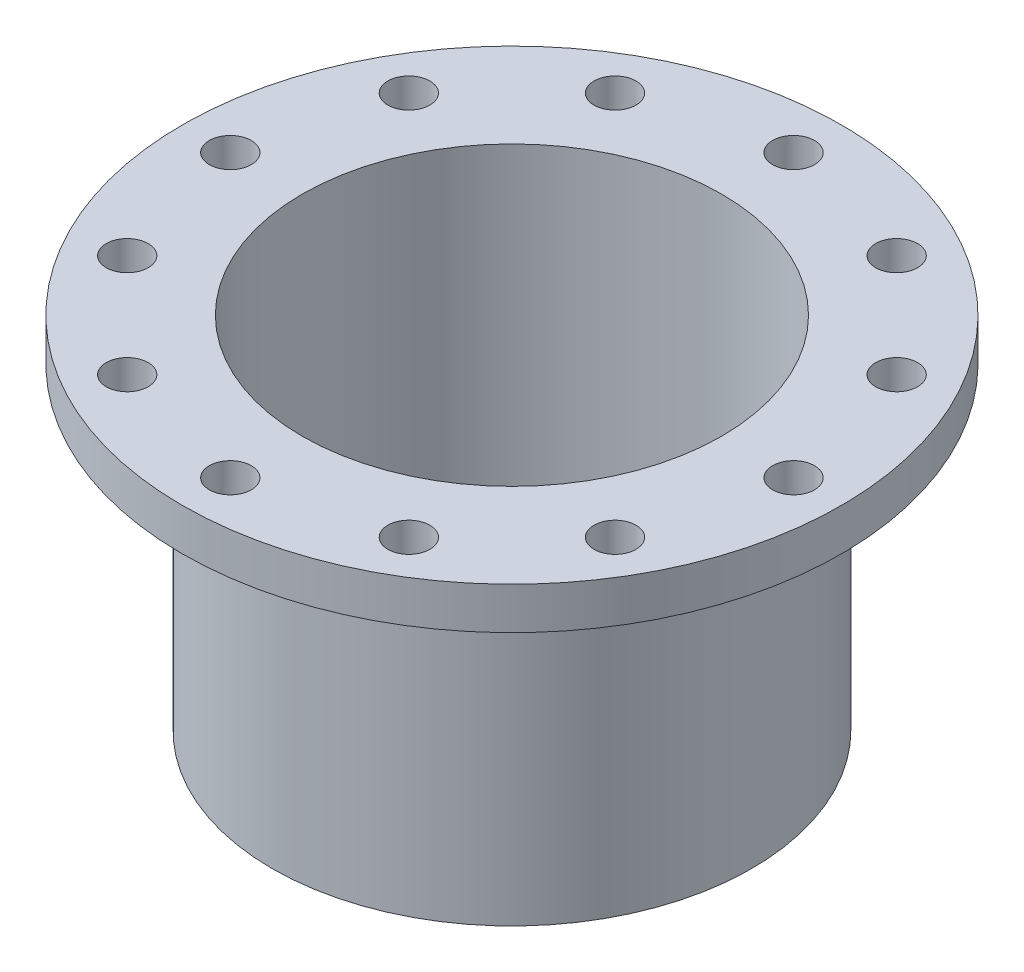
ISO-10303-21;
HEADER;
FILE_DESCRIPTION(('STEP AP214'),'2;1');
FILE_NAME('part.step','',(''),(''),'','','');
FILE_SCHEMA(('AUTOMOTIVE_DESIGN { 1 0 10303 214 1 1 1 1 }'));
ENDSEC;
DATA;
#1=APPLICATION_CONTEXT('core data for automotive mechanical design processes');
#2=APPLICATION_PROTOCOL_DEFINITION('international standard','automotive_design',2000,#1);
#3=PRODUCT_CONTEXT('',#1,'mechanical');
#4=PRODUCT('Part','Part','',(#3));
#5=PRODUCT_RELATED_PRODUCT_CATEGORY('part','',(#4));
#6=PRODUCT_DEFINITION_FORMATION('','',#4);
#7=PRODUCT_DEFINITION_CONTEXT('part definition',#1,'design');
#8=PRODUCT_DEFINITION('design','',#6,#7);
#9=PRODUCT_DEFINITION_SHAPE('','',#8);
#10=(LENGTH_UNIT() NAMED_UNIT(*) SI_UNIT(.MILLI.,.METRE.));
#11=(NAMED_UNIT(*) PLANE_ANGLE_UNIT() SI_UNIT($,.RADIAN.));
#12=(NAMED_UNIT(*) SI_UNIT($,.STERADIAN.) SOLID_ANGLE_UNIT());
#13=UNCERTAINTY_MEASURE_WITH_UNIT(LENGTH_MEASURE(1.E-05),#10,'distance_accuracy_value','');
#14=(GEOMETRIC_REPRESENTATION_CONTEXT(3) GLOBAL_UNCERTAINTY_ASSIGNED_CONTEXT((#13)) GLOBAL_UNIT_ASSIGNED_CONTEXT((#10,
#11,#12)) REPRESENTATION_CONTEXT('',''));
#15=CARTESIAN_POINT('',(0.,0.,0.));
#16=DIRECTION('',(0.,0.,1.));
#17=DIRECTION('',(1.,0.,0.));
#18=AXIS2_PLACEMENT_3D('',#15,#16,#17);
#19=CARTESIAN_POINT('',(0.,300.,0.));
#20=DIRECTION('',(0.,-1.,0.));
#21=DIRECTION('',(0.,0.,-1.));
#22=AXIS2_PLACEMENT_3D('',#19,#20,#21);
#23=CYLINDRICAL_SURFACE('',#22,200.);
#24=CARTESIAN_POINT('',(0.,0.,0.));
#25=DIRECTION('',(0.,1.,0.));
#26=DIRECTION('',(0.,0.,1.));
#27=AXIS2_PLACEMENT_3D('',#24,#25,#26);
#28=CIRCLE('',#27,200.);
#29=CARTESIAN_POINT('',(0.,0.,200.));
#30=VERTEX_POINT('',#29);
#31=EDGE_CURVE('E43',#30,#30,#28,.T.);
#32=ORIENTED_EDGE('',*,*,#31,.T.);
#33=EDGE_LOOP('',(#32));
#34=FACE_BOUND('',#33,.T.);
#35=CARTESIAN_POINT('',(0.,265.,0.));
#36=DIRECTION('',(0.,1.,0.));
#37=DIRECTION('',(0.,0.,1.));
#38=AXIS2_PLACEMENT_3D('',#35,#36,#37);
#39=CIRCLE('',#38,200.);
#40=CARTESIAN_POINT('',(0.,265.,200.));
#41=VERTEX_POINT('',#40);
#42=EDGE_CURVE('E10',#41,#41,#39,.T.);
#43=ORIENTED_EDGE('',*,*,#42,.F.);
#44=EDGE_LOOP('',(#43));
#45=FACE_BOUND('',#44,.T.);
#46=ADVANCED_FACE('F40',(#34,#45),#23,.T.);
#47=CARTESIAN_POINT('',(0.,300.,0.));
#48=DIRECTION('',(0.,1.,0.));
#49=DIRECTION('',(0.,0.,1.));
#50=AXIS2_PLACEMENT_3D('',#47,#48,#49);
#51=PLANE('',#50);
#52=CARTESIAN_POINT('',(-203.515969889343,300.,-117.5));
#53=DIRECTION('',(0.,1.,0.));
#54=DIRECTION('',(0.86602540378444,0.,0.499999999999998));
#55=AXIS2_PLACEMENT_3D('',#52,#53,#54);
#56=CIRCLE('',#55,17.5);
#57=CARTESIAN_POINT('',(-203.515969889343,300.,-99.9999999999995));
#58=VERTEX_POINT('',#57);
#59=EDGE_CURVE('E144',#58,#58,#56,.T.);
#60=ORIENTED_EDGE('',*,*,#59,.F.);
#61=EDGE_LOOP('',(#60));
#62=FACE_BOUND('',#61,.T.);
#63=CARTESIAN_POINT('',(-235.,300.,8.20498114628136E-13));
#64=DIRECTION('',(0.,1.,0.));
#65=DIRECTION('',(1.,0.,0.));
#66=AXIS2_PLACEMENT_3D('',#63,#64,#65);
#67=CIRCLE('',#66,17.5);
#68=CARTESIAN_POINT('',(-235.,300.,17.5000000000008));
#69=VERTEX_POINT('',#68);
#70=EDGE_CURVE('E136',#69,#69,#67,.T.);
#71=ORIENTED_EDGE('',*,*,#70,.F.);
#72=EDGE_LOOP('',(#71));
#73=FACE_BOUND('',#72,.T.);
#74=CARTESIAN_POINT('',(-203.515969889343,300.,117.500000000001));
#75=DIRECTION('',(0.,1.,0.));
#76=DIRECTION('',(0.866025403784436,0.,-0.500000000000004));
#77=AXIS2_PLACEMENT_3D('',#74,#75,#76);
#78=CIRCLE('',#77,17.5);
#79=CARTESIAN_POINT('',(-203.515969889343,300.,135.000000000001));
#80=VERTEX_POINT('',#79);
#81=EDGE_CURVE('E128',#80,#80,#78,.T.);
#82=ORIENTED_EDGE('',*,*,#81,.F.);
#83=EDGE_LOOP('',(#82));
#84=FACE_BOUND('',#83,.T.);
#85=CARTESIAN_POINT('',(-117.499999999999,300.,203.515969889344));
#86=DIRECTION('',(0.,1.,0.));
#87=DIRECTION('',(0.499999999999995,0.,-0.866025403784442));
#88=AXIS2_PLACEMENT_3D('',#85,#86,#87);
#89=CIRCLE('',#88,17.5);
#90=CARTESIAN_POINT('',(-117.499999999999,300.,221.015969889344));
#91=VERTEX_POINT('',#90);
#92=EDGE_CURVE('E120',#91,#91,#89,.T.);
#93=ORIENTED_EDGE('',*,*,#92,.F.);
#94=EDGE_LOOP('',(#93));
#95=FACE_BOUND('',#94,.T.);
#96=CARTESIAN_POINT('',(0.,300.,235.));
#97=DIRECTION('',(0.,1.,0.));
#98=DIRECTION('',(0.,0.,-1.));
#99=AXIS2_PLACEMENT_3D('',#96,#97,#98);
#100=CIRCLE('',#99,17.5);
#101=CARTESIAN_POINT('',(0.,300.,252.5));
#102=VERTEX_POINT('',#101);
#103=EDGE_CURVE('E112',#102,#102,#100,.T.);
#104=ORIENTED_EDGE('',*,*,#103,.F.);
#105=EDGE_LOOP('',(#104));
#106=FACE_BOUND('',#105,.T.);
#107=CARTESIAN_POINT('',(117.500000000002,300.,203.515969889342));
#108=DIRECTION('',(0.,1.,0.));
#109=DIRECTION('',(-0.500000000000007,0.,-0.866025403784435));
#110=AXIS2_PLACEMENT_3D('',#107,#108,#109);
#111=CIRCLE('',#110,17.5);
#112=CARTESIAN_POINT('',(117.500000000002,300.,221.015969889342));
#113=VERTEX_POINT('',#112);
#114=EDGE_CURVE('E104',#113,#113,#111,.T.);
#115=ORIENTED_EDGE('',*,*,#114,.F.);
#116=EDGE_LOOP('',(#115));
#117=FACE_BOUND('',#116,.T.);
#118=CARTESIAN_POINT('',(203.515969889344,300.,117.499999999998));
#119=DIRECTION('',(0.,1.,0.));
#120=DIRECTION('',(-0.866025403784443,0.,-0.499999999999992));
#121=AXIS2_PLACEMENT_3D('',#118,#119,#120);
#122=CIRCLE('',#121,17.5);
#123=CARTESIAN_POINT('',(203.515969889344,300.,134.999999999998));
#124=VERTEX_POINT('',#123);
#125=EDGE_CURVE('E94',#124,#124,#122,.T.);
#126=ORIENTED_EDGE('',*,*,#125,.F.);
#127=EDGE_LOOP('',(#126));
#128=FACE_BOUND('',#127,.T.);
#129=CARTESIAN_POINT('',(235.,300.,-2.46149434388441E-12));
#130=DIRECTION('',(0.,1.,0.));
#131=DIRECTION('',(-1.,0.,0.));
#132=AXIS2_PLACEMENT_3D('',#129,#130,#131);
#133=CIRCLE('',#132,17.5);
#134=CARTESIAN_POINT('',(235.,300.,17.4999999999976));
#135=VERTEX_POINT('',#134);
#136=EDGE_CURVE('E95',#135,#135,#133,.T.);
#137=ORIENTED_EDGE('',*,*,#136,.F.);
#138=EDGE_LOOP('',(#137));
#139=FACE_BOUND('',#138,.T.);
#140=CARTESIAN_POINT('',(203.515969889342,300.,-117.500000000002));
#141=DIRECTION('',(0.,1.,0.));
#142=DIRECTION('',(-0.866025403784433,0.,0.50000000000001));
#143=AXIS2_PLACEMENT_3D('',#140,#141,#142);
#144=CIRCLE('',#143,17.5);
#145=CARTESIAN_POINT('',(203.515969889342,300.,-100.000000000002));
#146=VERTEX_POINT('',#145);
#147=EDGE_CURVE('E158',#146,#146,#144,.T.);
#148=ORIENTED_EDGE('',*,*,#147,.F.);
#149=EDGE_LOOP('',(#148));
#150=FACE_BOUND('',#149,.T.);
#151=CARTESIAN_POINT('',(117.499999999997,300.,-203.515969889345));
#152=DIRECTION('',(0.,1.,0.));
#153=DIRECTION('',(-0.499999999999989,0.,0.866025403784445));
#154=AXIS2_PLACEMENT_3D('',#151,#152,#153);
#155=CIRCLE('',#154,17.5);
#156=CARTESIAN_POINT('',(117.499999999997,300.,-186.015969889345));
#157=VERTEX_POINT('',#156);
#158=EDGE_CURVE('E159',#157,#157,#155,.T.);
#159=ORIENTED_EDGE('',*,*,#158,.F.);
#160=EDGE_LOOP('',(#159));
#161=FACE_BOUND('',#160,.T.);
#162=CARTESIAN_POINT('',(-117.5,300.,-203.515969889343));
#163=DIRECTION('',(0.,1.,0.));
#164=DIRECTION('',(0.500000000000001,0.,0.866025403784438));
#165=AXIS2_PLACEMENT_3D('',#162,#163,#164);
#166=CIRCLE('',#165,17.5);
#167=CARTESIAN_POINT('',(-117.5,300.,-186.015969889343));
#168=VERTEX_POINT('',#167);
#169=EDGE_CURVE('E85',#168,#168,#166,.T.);
#170=ORIENTED_EDGE('',*,*,#169,.F.);
#171=EDGE_LOOP('',(#170));
#172=FACE_BOUND('',#171,.T.);
#173=CARTESIAN_POINT('',(0.,300.,-235.));
#174=DIRECTION('',(0.,1.,0.));
#175=DIRECTION('',(0.,0.,1.));
#176=AXIS2_PLACEMENT_3D('',#173,#174,#175);
#177=CIRCLE('',#176,17.5);
#178=CARTESIAN_POINT('',(0.,300.,-217.5));
#179=VERTEX_POINT('',#178);
#180=EDGE_CURVE('E77',#179,#179,#177,.T.);
#181=ORIENTED_EDGE('',*,*,#180,.F.);
#182=EDGE_LOOP('',(#181));
#183=FACE_BOUND('',#182,.T.);
#184=CARTESIAN_POINT('',(0.,300.,0.));
#185=DIRECTION('',(0.,1.,0.));
#186=DIRECTION('',(0.,0.,1.));
#187=AXIS2_PLACEMENT_3D('',#184,#185,#186);
#188=CIRCLE('',#187,175.);
#189=CARTESIAN_POINT('',(0.,300.,175.));
#190=VERTEX_POINT('',#189);
#191=EDGE_CURVE('E53',#190,#190,#188,.T.);
#192=ORIENTED_EDGE('',*,*,#191,.F.);
#193=EDGE_LOOP('',(#192));
#194=FACE_BOUND('',#193,.T.);
#195=CARTESIAN_POINT('',(0.,300.,0.));
#196=DIRECTION('',(0.,1.,0.));
#197=DIRECTION('',(0.,0.,1.));
#198=AXIS2_PLACEMENT_3D('',#195,#196,#197);
#199=CIRCLE('',#198,275.);
#200=CARTESIAN_POINT('',(0.,300.,275.));
#201=VERTEX_POINT('',#200);
#202=EDGE_CURVE('E56',#201,#201,#199,.T.);
#203=ORIENTED_EDGE('',*,*,#202,.T.);
#204=EDGE_LOOP('',(#203));
#205=FACE_BOUND('',#204,.T.);
#206=ADVANCED_FACE('F173',(#62,#73,#84,#95,#106,#117,#128,#139,#150,#161,#172,#183,#194,#205),
#51,.T.);
#207=CARTESIAN_POINT('',(0.,0.,0.));
#208=DIRECTION('',(0.,1.,0.));
#209=DIRECTION('',(0.,0.,1.));
#210=AXIS2_PLACEMENT_3D('',#207,#208,#209);
#211=PLANE('',#210);
#212=ORIENTED_EDGE('',*,*,#31,.F.);
#213=EDGE_LOOP('',(#212));
#214=FACE_BOUND('',#213,.T.);
#215=CARTESIAN_POINT('',(0.,0.,0.));
#216=DIRECTION('',(0.,1.,0.));
#217=DIRECTION('',(0.,0.,1.));
#218=AXIS2_PLACEMENT_3D('',#215,#216,#217);
#219=CIRCLE('',#218,175.);
#220=CARTESIAN_POINT('',(0.,0.,175.));
#221=VERTEX_POINT('',#220);
#222=EDGE_CURVE('E60',#221,#221,#219,.T.);
#223=ORIENTED_EDGE('',*,*,#222,.T.);
#224=EDGE_LOOP('',(#223));
#225=FACE_BOUND('',#224,.T.);
#226=ADVANCED_FACE('F176',(#214,#225),#211,.F.);
#227=CARTESIAN_POINT('',(0.,300.,0.));
#228=DIRECTION('',(0.,-1.,0.));
#229=DIRECTION('',(0.,0.,-1.));
#230=AXIS2_PLACEMENT_3D('',#227,#228,#229);
#231=CYLINDRICAL_SURFACE('',#230,175.);
#232=ORIENTED_EDGE('',*,*,#191,.T.);
#233=EDGE_LOOP('',(#232));
#234=FACE_BOUND('',#233,.T.);
#235=ORIENTED_EDGE('',*,*,#222,.F.);
#236=EDGE_LOOP('',(#235));
#237=FACE_BOUND('',#236,.T.);
#238=ADVANCED_FACE('F201',(#234,#237),#231,.F.);
#239=CARTESIAN_POINT('',(0.,265.,0.));
#240=DIRECTION('',(0.,1.,0.));
#241=DIRECTION('',(0.,0.,1.));
#242=AXIS2_PLACEMENT_3D('',#239,#240,#241);
#243=PLANE('',#242);
#244=CARTESIAN_POINT('',(-203.515969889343,265.,-117.5));
#245=DIRECTION('',(0.,1.,0.));
#246=DIRECTION('',(0.,0.,1.));
#247=AXIS2_PLACEMENT_3D('',#244,#245,#246);
#248=CIRCLE('',#247,17.5);
#249=CARTESIAN_POINT('',(-203.515969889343,265.,-99.9999999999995));
#250=VERTEX_POINT('',#249);
#251=EDGE_CURVE('E89',#250,#250,#248,.F.);
#252=ORIENTED_EDGE('',*,*,#251,.F.);
#253=EDGE_LOOP('',(#252));
#254=FACE_BOUND('',#253,.T.);
#255=CARTESIAN_POINT('',(-235.,265.,8.20498114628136E-13));
#256=DIRECTION('',(0.,1.,0.));
#257=DIRECTION('',(0.,0.,1.));
#258=AXIS2_PLACEMENT_3D('',#255,#256,#257);
#259=CIRCLE('',#258,17.5);
#260=CARTESIAN_POINT('',(-235.,265.,17.5000000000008));
#261=VERTEX_POINT('',#260);
#262=EDGE_CURVE('E140',#261,#261,#259,.F.);
#263=ORIENTED_EDGE('',*,*,#262,.F.);
#264=EDGE_LOOP('',(#263));
#265=FACE_BOUND('',#264,.T.);
#266=CARTESIAN_POINT('',(-203.515969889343,265.,117.500000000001));
#267=DIRECTION('',(0.,1.,0.));
#268=DIRECTION('',(0.,0.,1.));
#269=AXIS2_PLACEMENT_3D('',#266,#267,#268);
#270=CIRCLE('',#269,17.5);
#271=CARTESIAN_POINT('',(-203.515969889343,265.,135.000000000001));
#272=VERTEX_POINT('',#271);
#273=EDGE_CURVE('E132',#272,#272,#270,.F.);
#274=ORIENTED_EDGE('',*,*,#273,.F.);
#275=EDGE_LOOP('',(#274));
#276=FACE_BOUND('',#275,.T.);
#277=CARTESIAN_POINT('',(-117.499999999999,265.,203.515969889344));
#278=DIRECTION('',(0.,1.,0.));
#279=DIRECTION('',(0.,0.,1.));
#280=AXIS2_PLACEMENT_3D('',#277,#278,#279);
#281=CIRCLE('',#280,17.5);
#282=CARTESIAN_POINT('',(-117.499999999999,265.,221.015969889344));
#283=VERTEX_POINT('',#282);
#284=EDGE_CURVE('E124',#283,#283,#281,.F.);
#285=ORIENTED_EDGE('',*,*,#284,.F.);
#286=EDGE_LOOP('',(#285));
#287=FACE_BOUND('',#286,.T.);
#288=CARTESIAN_POINT('',(0.,265.,235.));
#289=DIRECTION('',(0.,1.,0.));
#290=DIRECTION('',(0.,0.,1.));
#291=AXIS2_PLACEMENT_3D('',#288,#289,#290);
#292=CIRCLE('',#291,17.5);
#293=CARTESIAN_POINT('',(0.,265.,252.5));
#294=VERTEX_POINT('',#293);
#295=EDGE_CURVE('E116',#294,#294,#292,.F.);
#296=ORIENTED_EDGE('',*,*,#295,.F.);
#297=EDGE_LOOP('',(#296));
#298=FACE_BOUND('',#297,.T.);
#299=CARTESIAN_POINT('',(117.500000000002,265.,203.515969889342));
#300=DIRECTION('',(0.,1.,0.));
#301=DIRECTION('',(0.,0.,1.));
#302=AXIS2_PLACEMENT_3D('',#299,#300,#301);
#303=CIRCLE('',#302,17.5);
#304=CARTESIAN_POINT('',(117.500000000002,265.,221.015969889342));
#305=VERTEX_POINT('',#304);
#306=EDGE_CURVE('E108',#305,#305,#303,.F.);
#307=ORIENTED_EDGE('',*,*,#306,.F.);
#308=EDGE_LOOP('',(#307));
#309=FACE_BOUND('',#308,.T.);
#310=CARTESIAN_POINT('',(203.515969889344,265.,117.499999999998));
#311=DIRECTION('',(0.,1.,0.));
#312=DIRECTION('',(0.,0.,1.));
#313=AXIS2_PLACEMENT_3D('',#310,#311,#312);
#314=CIRCLE('',#313,17.5);
#315=CARTESIAN_POINT('',(203.515969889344,265.,134.999999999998));
#316=VERTEX_POINT('',#315);
#317=EDGE_CURVE('E100',#316,#316,#314,.F.);
#318=ORIENTED_EDGE('',*,*,#317,.F.);
#319=EDGE_LOOP('',(#318));
#320=FACE_BOUND('',#319,.T.);
#321=CARTESIAN_POINT('',(235.,265.,-2.46149434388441E-12));
#322=DIRECTION('',(0.,1.,0.));
#323=DIRECTION('',(0.,0.,1.));
#324=AXIS2_PLACEMENT_3D('',#321,#322,#323);
#325=CIRCLE('',#324,17.5);
#326=CARTESIAN_POINT('',(235.,265.,17.4999999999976));
#327=VERTEX_POINT('',#326);
#328=EDGE_CURVE('E90',#327,#327,#325,.F.);
#329=ORIENTED_EDGE('',*,*,#328,.F.);
#330=EDGE_LOOP('',(#329));
#331=FACE_BOUND('',#330,.T.);
#332=CARTESIAN_POINT('',(203.515969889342,265.,-117.500000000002));
#333=DIRECTION('',(0.,1.,0.));
#334=DIRECTION('',(0.,0.,1.));
#335=AXIS2_PLACEMENT_3D('',#332,#333,#334);
#336=CIRCLE('',#335,17.5);
#337=CARTESIAN_POINT('',(203.515969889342,265.,-100.000000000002));
#338=VERTEX_POINT('',#337);
#339=EDGE_CURVE('E99',#338,#338,#336,.F.);
#340=ORIENTED_EDGE('',*,*,#339,.F.);
#341=EDGE_LOOP('',(#340));
#342=FACE_BOUND('',#341,.T.);
#343=CARTESIAN_POINT('',(117.499999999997,265.,-203.515969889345));
#344=DIRECTION('',(0.,1.,0.));
#345=DIRECTION('',(0.,0.,1.));
#346=AXIS2_PLACEMENT_3D('',#343,#344,#345);
#347=CIRCLE('',#346,17.5);
#348=CARTESIAN_POINT('',(117.499999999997,265.,-186.015969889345));
#349=VERTEX_POINT('',#348);
#350=EDGE_CURVE('E154',#349,#349,#347,.F.);
#351=ORIENTED_EDGE('',*,*,#350,.F.);
#352=EDGE_LOOP('',(#351));
#353=FACE_BOUND('',#352,.T.);
#354=CARTESIAN_POINT('',(-117.5,265.,-203.515969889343));
#355=DIRECTION('',(0.,1.,0.));
#356=DIRECTION('',(0.,0.,1.));
#357=AXIS2_PLACEMENT_3D('',#354,#355,#356);
#358=CIRCLE('',#357,17.5);
#359=CARTESIAN_POINT('',(-117.5,265.,-186.015969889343));
#360=VERTEX_POINT('',#359);
#361=EDGE_CURVE('E81',#360,#360,#358,.F.);
#362=ORIENTED_EDGE('',*,*,#361,.F.);
#363=EDGE_LOOP('',(#362));
#364=FACE_BOUND('',#363,.T.);
#365=CARTESIAN_POINT('',(0.,265.,-235.));
#366=DIRECTION('',(0.,1.,0.));
#367=DIRECTION('',(0.,0.,1.));
#368=AXIS2_PLACEMENT_3D('',#365,#366,#367);
#369=CIRCLE('',#368,17.5);
#370=CARTESIAN_POINT('',(0.,265.,-217.5));
#371=VERTEX_POINT('',#370);
#372=EDGE_CURVE('E72',#371,#371,#369,.F.);
#373=ORIENTED_EDGE('',*,*,#372,.F.);
#374=EDGE_LOOP('',(#373));
#375=FACE_BOUND('',#374,.T.);
#376=CARTESIAN_POINT('',(0.,265.,0.));
#377=DIRECTION('',(0.,1.,0.));
#378=DIRECTION('',(0.,0.,1.));
#379=AXIS2_PLACEMENT_3D('',#376,#377,#378);
#380=CIRCLE('',#379,275.);
#381=CARTESIAN_POINT('',(0.,265.,275.));
#382=VERTEX_POINT('',#381);
#383=EDGE_CURVE('E63',#382,#382,#380,.T.);
#384=ORIENTED_EDGE('',*,*,#383,.F.);
#385=EDGE_LOOP('',(#384));
#386=FACE_BOUND('',#385,.T.);
#387=ORIENTED_EDGE('',*,*,#42,.T.);
#388=EDGE_LOOP('',(#387));
#389=FACE_BOUND('',#388,.T.);
#390=ADVANCED_FACE('F192',(#254,#265,#276,#287,#298,#309,#320,#331,#342,#353,#364,#375,#386,
#389),#243,.F.);
#391=CARTESIAN_POINT('',(0.,265.,0.));
#392=DIRECTION('',(0.,1.,0.));
#393=DIRECTION('',(0.,0.,1.));
#394=AXIS2_PLACEMENT_3D('',#391,#392,#393);
#395=CYLINDRICAL_SURFACE('',#394,275.);
#396=ORIENTED_EDGE('',*,*,#383,.T.);
#397=EDGE_LOOP('',(#396));
#398=FACE_BOUND('',#397,.T.);
#399=ORIENTED_EDGE('',*,*,#202,.F.);
#400=EDGE_LOOP('',(#399));
#401=FACE_BOUND('',#400,.T.);
#402=ADVANCED_FACE('F189',(#398,#401),#395,.T.);
#403=CARTESIAN_POINT('',(0.,-0.000999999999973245,-235.));
#404=DIRECTION('',(0.,1.,0.));
#405=DIRECTION('',(0.,0.,1.));
#406=AXIS2_PLACEMENT_3D('',#403,#404,#405);
#407=CYLINDRICAL_SURFACE('',#406,17.5);
#408=CARTESIAN_POINT('',(0.,300.,-217.5));
#409=CARTESIAN_POINT('',(0.,299.635416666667,-217.5));
#410=CARTESIAN_POINT('',(0.,299.270833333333,-217.5));
#411=CARTESIAN_POINT('',(0.,298.541666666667,-217.5));
#412=CARTESIAN_POINT('',(0.,298.177083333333,-217.5));
#413=CARTESIAN_POINT('',(0.,297.447916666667,-217.5));
#414=CARTESIAN_POINT('',(0.,297.083333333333,-217.5));
#415=CARTESIAN_POINT('',(0.,296.354166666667,-217.5));
#416=CARTESIAN_POINT('',(0.,295.989583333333,-217.5));
#417=CARTESIAN_POINT('',(0.,295.260416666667,-217.5));
#418=CARTESIAN_POINT('',(0.,294.895833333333,-217.5));
#419=CARTESIAN_POINT('',(0.,294.166666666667,-217.5));
#420=CARTESIAN_POINT('',(0.,293.802083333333,-217.5));
#421=CARTESIAN_POINT('',(0.,293.072916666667,-217.5));
#422=CARTESIAN_POINT('',(0.,292.708333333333,-217.5));
#423=CARTESIAN_POINT('',(0.,291.979166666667,-217.5));
#424=CARTESIAN_POINT('',(0.,291.614583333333,-217.5));
#425=CARTESIAN_POINT('',(0.,290.885416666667,-217.5));
#426=CARTESIAN_POINT('',(0.,290.520833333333,-217.5));
#427=CARTESIAN_POINT('',(0.,289.791666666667,-217.5));
#428=CARTESIAN_POINT('',(0.,289.427083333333,-217.5));
#429=CARTESIAN_POINT('',(0.,288.697916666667,-217.5));
#430=CARTESIAN_POINT('',(0.,288.333333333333,-217.5));
#431=CARTESIAN_POINT('',(0.,287.604166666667,-217.5));
#432=CARTESIAN_POINT('',(0.,287.239583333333,-217.5));
#433=CARTESIAN_POINT('',(0.,286.510416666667,-217.5));
#434=CARTESIAN_POINT('',(0.,286.145833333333,-217.5));
#435=CARTESIAN_POINT('',(0.,285.416666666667,-217.5));
#436=CARTESIAN_POINT('',(0.,285.052083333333,-217.5));
#437=CARTESIAN_POINT('',(0.,284.322916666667,-217.5));
#438=CARTESIAN_POINT('',(0.,283.958333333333,-217.5));
#439=CARTESIAN_POINT('',(0.,283.229166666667,-217.5));
#440=CARTESIAN_POINT('',(0.,282.864583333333,-217.5));
#441=CARTESIAN_POINT('',(0.,282.135416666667,-217.5));
#442=CARTESIAN_POINT('',(0.,281.770833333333,-217.5));
#443=CARTESIAN_POINT('',(0.,281.041666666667,-217.5));
#444=CARTESIAN_POINT('',(0.,280.677083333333,-217.5));
#445=CARTESIAN_POINT('',(0.,279.947916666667,-217.5));
#446=CARTESIAN_POINT('',(0.,279.583333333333,-217.5));
#447=CARTESIAN_POINT('',(0.,278.854166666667,-217.5));
#448=CARTESIAN_POINT('',(0.,278.489583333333,-217.5));
#449=CARTESIAN_POINT('',(0.,277.760416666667,-217.5));
#450=CARTESIAN_POINT('',(0.,277.395833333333,-217.5));
#451=CARTESIAN_POINT('',(0.,276.666666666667,-217.5));
#452=CARTESIAN_POINT('',(0.,276.302083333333,-217.5));
#453=CARTESIAN_POINT('',(0.,275.572916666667,-217.5));
#454=CARTESIAN_POINT('',(0.,275.208333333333,-217.5));
#455=CARTESIAN_POINT('',(0.,274.479166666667,-217.5));
#456=CARTESIAN_POINT('',(0.,274.114583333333,-217.5));
#457=CARTESIAN_POINT('',(0.,273.385416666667,-217.5));
#458=CARTESIAN_POINT('',(0.,273.020833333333,-217.5));
#459=CARTESIAN_POINT('',(0.,272.291666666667,-217.5));
#460=CARTESIAN_POINT('',(0.,271.927083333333,-217.5));
#461=CARTESIAN_POINT('',(0.,271.197916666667,-217.5));
#462=CARTESIAN_POINT('',(0.,270.833333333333,-217.5));
#463=CARTESIAN_POINT('',(0.,270.104166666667,-217.5));
#464=CARTESIAN_POINT('',(0.,269.739583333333,-217.5));
#465=CARTESIAN_POINT('',(0.,269.010416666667,-217.5));
#466=CARTESIAN_POINT('',(0.,268.645833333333,-217.5));
#467=CARTESIAN_POINT('',(0.,267.916666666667,-217.5));
#468=CARTESIAN_POINT('',(0.,267.552083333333,-217.5));
#469=CARTESIAN_POINT('',(0.,266.822916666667,-217.5));
#470=CARTESIAN_POINT('',(0.,266.458333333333,-217.5));
#471=CARTESIAN_POINT('',(0.,265.729166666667,-217.5));
#472=CARTESIAN_POINT('',(0.,265.364583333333,-217.5));
#473=CARTESIAN_POINT('',(0.,265.,-217.5));
#474=B_SPLINE_CURVE_WITH_KNOTS('',3,(#408,#409,#410,#411,#412,#413,#414,#415,#416,#417,#418,
#419,#420,#421,#422,#423,#424,#425,#426,#427,#428,#429,#430,#431,#432,#433,#434,#435,#436,#437,
#438,#439,#440,#441,#442,#443,#444,#445,#446,#447,#448,#449,#450,#451,#452,#453,#454,#455,#456,
#457,#458,#459,#460,#461,#462,#463,#464,#465,#466,#467,#468,#469,#470,#471,#472,#473),
.UNSPECIFIED.,.F.,.F.,(4,2,2,2,2,2,2,2,2,2,2,2,2,2,2,2,2,2,2,2,2,2,2,2,2,2,2,2,2,2,2,2,4),(0.,
1.09375,2.18750000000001,3.28125000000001,4.37500000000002,5.46874999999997,6.56249999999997,
7.65624999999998,8.74999999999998,9.84374999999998,10.9375,12.03125,13.1249999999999,
14.2187499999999,15.3125,16.40625,17.5,18.59375,19.6875,20.78125,21.875,22.9687499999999,
24.0624999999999,25.1562499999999,26.2499999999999,27.3437499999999,28.4375,29.53125,
30.6249999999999,31.7187499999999,32.8124999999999,33.9062499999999,34.9999999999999),.UNSPECIFIED.);
#475=EDGE_CURVE('BSEAM191',#179,#371,#474,.T.);
#476=ORIENTED_EDGE('',*,*,#180,.T.);
#477=ORIENTED_EDGE('',*,*,#372,.T.);
#478=ORIENTED_EDGE('',*,*,#475,.T.);
#479=ORIENTED_EDGE('',*,*,#475,.F.);
#480=EDGE_LOOP('',(#476,#478,#477,#479));
#481=FACE_BOUND('',#480,.T.);
#482=ADVANCED_FACE('F191',(#481),#407,.F.);
#483=CARTESIAN_POINT('',(-117.5,-0.000999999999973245,-203.515969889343));
#484=DIRECTION('',(0.,1.,0.));
#485=DIRECTION('',(0.,0.,1.));
#486=AXIS2_PLACEMENT_3D('',#483,#484,#485);
#487=CYLINDRICAL_SURFACE('',#486,17.5);
#488=CARTESIAN_POINT('',(-117.5,300.,-186.015969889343));
#489=CARTESIAN_POINT('',(-117.5,299.635416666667,-186.015969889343));
#490=CARTESIAN_POINT('',(-117.5,299.270833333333,-186.015969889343));
#491=CARTESIAN_POINT('',(-117.5,298.541666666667,-186.015969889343));
#492=CARTESIAN_POINT('',(-117.5,298.177083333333,-186.015969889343));
#493=CARTESIAN_POINT('',(-117.5,297.447916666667,-186.015969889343));
#494=CARTESIAN_POINT('',(-117.5,297.083333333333,-186.015969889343));
#495=CARTESIAN_POINT('',(-117.5,296.354166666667,-186.015969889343));
#496=CARTESIAN_POINT('',(-117.5,295.989583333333,-186.015969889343));
#497=CARTESIAN_POINT('',(-117.5,295.260416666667,-186.015969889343));
#498=CARTESIAN_POINT('',(-117.5,294.895833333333,-186.015969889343));
#499=CARTESIAN_POINT('',(-117.5,294.166666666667,-186.015969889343));
#500=CARTESIAN_POINT('',(-117.5,293.802083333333,-186.015969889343));
#501=CARTESIAN_POINT('',(-117.5,293.072916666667,-186.015969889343));
#502=CARTESIAN_POINT('',(-117.5,292.708333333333,-186.015969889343));
#503=CARTESIAN_POINT('',(-117.5,291.979166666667,-186.015969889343));
#504=CARTESIAN_POINT('',(-117.5,291.614583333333,-186.015969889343));
#505=CARTESIAN_POINT('',(-117.5,290.885416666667,-186.015969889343));
#506=CARTESIAN_POINT('',(-117.5,290.520833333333,-186.015969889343));
#507=CARTESIAN_POINT('',(-117.5,289.791666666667,-186.015969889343));
#508=CARTESIAN_POINT('',(-117.5,289.427083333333,-186.015969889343));
#509=CARTESIAN_POINT('',(-117.5,288.697916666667,-186.015969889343));
#510=CARTESIAN_POINT('',(-117.5,288.333333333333,-186.015969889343));
#511=CARTESIAN_POINT('',(-117.5,287.604166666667,-186.015969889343));
#512=CARTESIAN_POINT('',(-117.5,287.239583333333,-186.015969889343));
#513=CARTESIAN_POINT('',(-117.5,286.510416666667,-186.015969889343));
#514=CARTESIAN_POINT('',(-117.5,286.145833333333,-186.015969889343));
#515=CARTESIAN_POINT('',(-117.5,285.416666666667,-186.015969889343));
#516=CARTESIAN_POINT('',(-117.5,285.052083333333,-186.015969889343));
#517=CARTESIAN_POINT('',(-117.5,284.322916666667,-186.015969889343));
#518=CARTESIAN_POINT('',(-117.5,283.958333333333,-186.015969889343));
#519=CARTESIAN_POINT('',(-117.5,283.229166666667,-186.015969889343));
#520=CARTESIAN_POINT('',(-117.5,282.864583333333,-186.015969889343));
#521=CARTESIAN_POINT('',(-117.5,282.135416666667,-186.015969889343));
#522=CARTESIAN_POINT('',(-117.5,281.770833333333,-186.015969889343));
#523=CARTESIAN_POINT('',(-117.5,281.041666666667,-186.015969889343));
#524=CARTESIAN_POINT('',(-117.5,280.677083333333,-186.015969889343));
#525=CARTESIAN_POINT('',(-117.5,279.947916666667,-186.015969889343));
#526=CARTESIAN_POINT('',(-117.5,279.583333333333,-186.015969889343));
#527=CARTESIAN_POINT('',(-117.5,278.854166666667,-186.015969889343));
#528=CARTESIAN_POINT('',(-117.5,278.489583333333,-186.015969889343));
#529=CARTESIAN_POINT('',(-117.5,277.760416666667,-186.015969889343));
#530=CARTESIAN_POINT('',(-117.5,277.395833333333,-186.015969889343));
#531=CARTESIAN_POINT('',(-117.5,276.666666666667,-186.015969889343));
#532=CARTESIAN_POINT('',(-117.5,276.302083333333,-186.015969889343));
#533=CARTESIAN_POINT('',(-117.5,275.572916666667,-186.015969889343));
#534=CARTESIAN_POINT('',(-117.5,275.208333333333,-186.015969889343));
#535=CARTESIAN_POINT('',(-117.5,274.479166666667,-186.015969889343));
#536=CARTESIAN_POINT('',(-117.5,274.114583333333,-186.015969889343));
#537=CARTESIAN_POINT('',(-117.5,273.385416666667,-186.015969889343));
#538=CARTESIAN_POINT('',(-117.5,273.020833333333,-186.015969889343));
#539=CARTESIAN_POINT('',(-117.5,272.291666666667,-186.015969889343));
#540=CARTESIAN_POINT('',(-117.5,271.927083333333,-186.015969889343));
#541=CARTESIAN_POINT('',(-117.5,271.197916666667,-186.015969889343));
#542=CARTESIAN_POINT('',(-117.5,270.833333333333,-186.015969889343));
#543=CARTESIAN_POINT('',(-117.5,270.104166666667,-186.015969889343));
#544=CARTESIAN_POINT('',(-117.5,269.739583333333,-186.015969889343));
#545=CARTESIAN_POINT('',(-117.5,269.010416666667,-186.015969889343));
#546=CARTESIAN_POINT('',(-117.5,268.645833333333,-186.015969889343));
#547=CARTESIAN_POINT('',(-117.5,267.916666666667,-186.015969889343));
#548=CARTESIAN_POINT('',(-117.5,267.552083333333,-186.015969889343));
#549=CARTESIAN_POINT('',(-117.5,266.822916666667,-186.015969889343));
#550=CARTESIAN_POINT('',(-117.5,266.458333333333,-186.015969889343));
#551=CARTESIAN_POINT('',(-117.5,265.729166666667,-186.015969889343));
#552=CARTESIAN_POINT('',(-117.5,265.364583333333,-186.015969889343));
#553=CARTESIAN_POINT('',(-117.5,265.,-186.015969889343));
#554=B_SPLINE_CURVE_WITH_KNOTS('',3,(#488,#489,#490,#491,#492,#493,#494,#495,#496,#497,#498,
#499,#500,#501,#502,#503,#504,#505,#506,#507,#508,#509,#510,#511,#512,#513,#514,#515,#516,#517,
#518,#519,#520,#521,#522,#523,#524,#525,#526,#527,#528,#529,#530,#531,#532,#533,#534,#535,#536,
#537,#538,#539,#540,#541,#542,#543,#544,#545,#546,#547,#548,#549,#550,#551,#552,#553),
.UNSPECIFIED.,.F.,.F.,(4,2,2,2,2,2,2,2,2,2,2,2,2,2,2,2,2,2,2,2,2,2,2,2,2,2,2,2,2,2,2,2,4),(0.,
1.09375,2.18750000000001,3.28125000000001,4.37500000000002,5.46874999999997,6.56249999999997,
7.65624999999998,8.74999999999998,9.84374999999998,10.9375,12.03125,13.1249999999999,
14.2187499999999,15.3125,16.40625,17.5,18.59375,19.6875,20.78125,21.875,22.9687499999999,
24.0624999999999,25.1562499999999,26.2499999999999,27.3437499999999,28.4375,29.53125,
30.6249999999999,31.7187499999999,32.8124999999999,33.9062499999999,34.9999999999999),.UNSPECIFIED.);
#555=EDGE_CURVE('BSEAM198',#168,#360,#554,.T.);
#556=ORIENTED_EDGE('',*,*,#169,.T.);
#557=ORIENTED_EDGE('',*,*,#361,.T.);
#558=ORIENTED_EDGE('',*,*,#555,.T.);
#559=ORIENTED_EDGE('',*,*,#555,.F.);
#560=EDGE_LOOP('',(#556,#558,#557,#559));
#561=FACE_BOUND('',#560,.T.);
#562=ADVANCED_FACE('F198',(#561),#487,.F.);
#563=CARTESIAN_POINT('',(117.499999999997,-0.000999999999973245,-203.515969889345));
#564=DIRECTION('',(0.,1.,0.));
#565=DIRECTION('',(0.,0.,1.));
#566=AXIS2_PLACEMENT_3D('',#563,#564,#565);
#567=CYLINDRICAL_SURFACE('',#566,17.5);
#568=CARTESIAN_POINT('',(117.499999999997,300.,-186.015969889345));
#569=CARTESIAN_POINT('',(117.499999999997,299.635416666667,-186.015969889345));
#570=CARTESIAN_POINT('',(117.499999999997,299.270833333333,-186.015969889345));
#571=CARTESIAN_POINT('',(117.499999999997,298.541666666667,-186.015969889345));
#572=CARTESIAN_POINT('',(117.499999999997,298.177083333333,-186.015969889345));
#573=CARTESIAN_POINT('',(117.499999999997,297.447916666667,-186.015969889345));
#574=CARTESIAN_POINT('',(117.499999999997,297.083333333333,-186.015969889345));
#575=CARTESIAN_POINT('',(117.499999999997,296.354166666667,-186.015969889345));
#576=CARTESIAN_POINT('',(117.499999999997,295.989583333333,-186.015969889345));
#577=CARTESIAN_POINT('',(117.499999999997,295.260416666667,-186.015969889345));
#578=CARTESIAN_POINT('',(117.499999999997,294.895833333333,-186.015969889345));
#579=CARTESIAN_POINT('',(117.499999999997,294.166666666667,-186.015969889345));
#580=CARTESIAN_POINT('',(117.499999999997,293.802083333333,-186.015969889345));
#581=CARTESIAN_POINT('',(117.499999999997,293.072916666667,-186.015969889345));
#582=CARTESIAN_POINT('',(117.499999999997,292.708333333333,-186.015969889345));
#583=CARTESIAN_POINT('',(117.499999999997,291.979166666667,-186.015969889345));
#584=CARTESIAN_POINT('',(117.499999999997,291.614583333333,-186.015969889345));
#585=CARTESIAN_POINT('',(117.499999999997,290.885416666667,-186.015969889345));
#586=CARTESIAN_POINT('',(117.499999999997,290.520833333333,-186.015969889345));
#587=CARTESIAN_POINT('',(117.499999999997,289.791666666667,-186.015969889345));
#588=CARTESIAN_POINT('',(117.499999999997,289.427083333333,-186.015969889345));
#589=CARTESIAN_POINT('',(117.499999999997,288.697916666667,-186.015969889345));
#590=CARTESIAN_POINT('',(117.499999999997,288.333333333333,-186.015969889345));
#591=CARTESIAN_POINT('',(117.499999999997,287.604166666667,-186.015969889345));
#592=CARTESIAN_POINT('',(117.499999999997,287.239583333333,-186.015969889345));
#593=CARTESIAN_POINT('',(117.499999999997,286.510416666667,-186.015969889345));
#594=CARTESIAN_POINT('',(117.499999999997,286.145833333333,-186.015969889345));
#595=CARTESIAN_POINT('',(117.499999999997,285.416666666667,-186.015969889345));
#596=CARTESIAN_POINT('',(117.499999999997,285.052083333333,-186.015969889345));
#597=CARTESIAN_POINT('',(117.499999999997,284.322916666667,-186.015969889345));
#598=CARTESIAN_POINT('',(117.499999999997,283.958333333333,-186.015969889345));
#599=CARTESIAN_POINT('',(117.499999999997,283.229166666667,-186.015969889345));
#600=CARTESIAN_POINT('',(117.499999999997,282.864583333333,-186.015969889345));
#601=CARTESIAN_POINT('',(117.499999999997,282.135416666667,-186.015969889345));
#602=CARTESIAN_POINT('',(117.499999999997,281.770833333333,-186.015969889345));
#603=CARTESIAN_POINT('',(117.499999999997,281.041666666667,-186.015969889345));
#604=CARTESIAN_POINT('',(117.499999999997,280.677083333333,-186.015969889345));
#605=CARTESIAN_POINT('',(117.499999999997,279.947916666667,-186.015969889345));
#606=CARTESIAN_POINT('',(117.499999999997,279.583333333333,-186.015969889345));
#607=CARTESIAN_POINT('',(117.499999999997,278.854166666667,-186.015969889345));
#608=CARTESIAN_POINT('',(117.499999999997,278.489583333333,-186.015969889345));
#609=CARTESIAN_POINT('',(117.499999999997,277.760416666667,-186.015969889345));
#610=CARTESIAN_POINT('',(117.499999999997,277.395833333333,-186.015969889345));
#611=CARTESIAN_POINT('',(117.499999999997,276.666666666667,-186.015969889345));
#612=CARTESIAN_POINT('',(117.499999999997,276.302083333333,-186.015969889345));
#613=CARTESIAN_POINT('',(117.499999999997,275.572916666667,-186.015969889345));
#614=CARTESIAN_POINT('',(117.499999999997,275.208333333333,-186.015969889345));
#615=CARTESIAN_POINT('',(117.499999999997,274.479166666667,-186.015969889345));
#616=CARTESIAN_POINT('',(117.499999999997,274.114583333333,-186.015969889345));
#617=CARTESIAN_POINT('',(117.499999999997,273.385416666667,-186.015969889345));
#618=CARTESIAN_POINT('',(117.499999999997,273.020833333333,-186.015969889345));
#619=CARTESIAN_POINT('',(117.499999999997,272.291666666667,-186.015969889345));
#620=CARTESIAN_POINT('',(117.499999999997,271.927083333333,-186.015969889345));
#621=CARTESIAN_POINT('',(117.499999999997,271.197916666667,-186.015969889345));
#622=CARTESIAN_POINT('',(117.499999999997,270.833333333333,-186.015969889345));
#623=CARTESIAN_POINT('',(117.499999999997,270.104166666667,-186.015969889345));
#624=CARTESIAN_POINT('',(117.499999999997,269.739583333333,-186.015969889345));
#625=CARTESIAN_POINT('',(117.499999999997,269.010416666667,-186.015969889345));
#626=CARTESIAN_POINT('',(117.499999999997,268.645833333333,-186.015969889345));
#627=CARTESIAN_POINT('',(117.499999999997,267.916666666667,-186.015969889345));
#628=CARTESIAN_POINT('',(117.499999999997,267.552083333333,-186.015969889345));
#629=CARTESIAN_POINT('',(117.499999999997,266.822916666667,-186.015969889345));
#630=CARTESIAN_POINT('',(117.499999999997,266.458333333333,-186.015969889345));
#631=CARTESIAN_POINT('',(117.499999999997,265.729166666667,-186.015969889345));
#632=CARTESIAN_POINT('',(117.499999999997,265.364583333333,-186.015969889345));
#633=CARTESIAN_POINT('',(117.499999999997,265.,-186.015969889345));
#634=B_SPLINE_CURVE_WITH_KNOTS('',3,(#568,#569,#570,#571,#572,#573,#574,#575,#576,#577,#578,
#579,#580,#581,#582,#583,#584,#585,#586,#587,#588,#589,#590,#591,#592,#593,#594,#595,#596,#597,
#598,#599,#600,#601,#602,#603,#604,#605,#606,#607,#608,#609,#610,#611,#612,#613,#614,#615,#616,
#617,#618,#619,#620,#621,#622,#623,#624,#625,#626,#627,#628,#629,#630,#631,#632,#633),
.UNSPECIFIED.,.F.,.F.,(4,2,2,2,2,2,2,2,2,2,2,2,2,2,2,2,2,2,2,2,2,2,2,2,2,2,2,2,2,2,2,2,4),(0.,
1.09375,2.18750000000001,3.28125000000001,4.37500000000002,5.46874999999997,6.56249999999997,
7.65624999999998,8.74999999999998,9.84374999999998,10.9375,12.03125,13.1249999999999,
14.2187499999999,15.3125,16.40625,17.5,18.59375,19.6875,20.78125,21.875,22.9687499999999,
24.0624999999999,25.1562499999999,26.2499999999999,27.3437499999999,28.4375,29.53125,
30.6249999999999,31.7187499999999,32.8124999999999,33.9062499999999,34.9999999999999),.UNSPECIFIED.);
#635=EDGE_CURVE('BSEAM238',#157,#349,#634,.T.);
#636=ORIENTED_EDGE('',*,*,#158,.T.);
#637=ORIENTED_EDGE('',*,*,#350,.T.);
#638=ORIENTED_EDGE('',*,*,#635,.T.);
#639=ORIENTED_EDGE('',*,*,#635,.F.);
#640=EDGE_LOOP('',(#636,#638,#637,#639));
#641=FACE_BOUND('',#640,.T.);
#642=ADVANCED_FACE('F238',(#641),#567,.F.);
#643=CARTESIAN_POINT('',(203.515969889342,-0.000999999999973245,-117.500000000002));
#644=DIRECTION('',(0.,1.,0.));
#645=DIRECTION('',(0.,0.,1.));
#646=AXIS2_PLACEMENT_3D('',#643,#644,#645);
#647=CYLINDRICAL_SURFACE('',#646,17.5);
#648=CARTESIAN_POINT('',(203.515969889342,300.,-100.000000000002));
#649=CARTESIAN_POINT('',(203.515969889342,299.635416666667,-100.000000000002));
#650=CARTESIAN_POINT('',(203.515969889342,299.270833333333,-100.000000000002));
#651=CARTESIAN_POINT('',(203.515969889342,298.541666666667,-100.000000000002));
#652=CARTESIAN_POINT('',(203.515969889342,298.177083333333,-100.000000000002));
#653=CARTESIAN_POINT('',(203.515969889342,297.447916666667,-100.000000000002));
#654=CARTESIAN_POINT('',(203.515969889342,297.083333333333,-100.000000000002));
#655=CARTESIAN_POINT('',(203.515969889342,296.354166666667,-100.000000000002));
#656=CARTESIAN_POINT('',(203.515969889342,295.989583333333,-100.000000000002));
#657=CARTESIAN_POINT('',(203.515969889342,295.260416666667,-100.000000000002));
#658=CARTESIAN_POINT('',(203.515969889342,294.895833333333,-100.000000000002));
#659=CARTESIAN_POINT('',(203.515969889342,294.166666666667,-100.000000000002));
#660=CARTESIAN_POINT('',(203.515969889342,293.802083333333,-100.000000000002));
#661=CARTESIAN_POINT('',(203.515969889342,293.072916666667,-100.000000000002));
#662=CARTESIAN_POINT('',(203.515969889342,292.708333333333,-100.000000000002));
#663=CARTESIAN_POINT('',(203.515969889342,291.979166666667,-100.000000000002));
#664=CARTESIAN_POINT('',(203.515969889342,291.614583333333,-100.000000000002));
#665=CARTESIAN_POINT('',(203.515969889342,290.885416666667,-100.000000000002));
#666=CARTESIAN_POINT('',(203.515969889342,290.520833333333,-100.000000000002));
#667=CARTESIAN_POINT('',(203.515969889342,289.791666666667,-100.000000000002));
#668=CARTESIAN_POINT('',(203.515969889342,289.427083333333,-100.000000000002));
#669=CARTESIAN_POINT('',(203.515969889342,288.697916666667,-100.000000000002));
#670=CARTESIAN_POINT('',(203.515969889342,288.333333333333,-100.000000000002));
#671=CARTESIAN_POINT('',(203.515969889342,287.604166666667,-100.000000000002));
#672=CARTESIAN_POINT('',(203.515969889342,287.239583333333,-100.000000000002));
#673=CARTESIAN_POINT('',(203.515969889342,286.510416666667,-100.000000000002));
#674=CARTESIAN_POINT('',(203.515969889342,286.145833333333,-100.000000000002));
#675=CARTESIAN_POINT('',(203.515969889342,285.416666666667,-100.000000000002));
#676=CARTESIAN_POINT('',(203.515969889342,285.052083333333,-100.000000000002));
#677=CARTESIAN_POINT('',(203.515969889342,284.322916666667,-100.000000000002));
#678=CARTESIAN_POINT('',(203.515969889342,283.958333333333,-100.000000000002));
#679=CARTESIAN_POINT('',(203.515969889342,283.229166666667,-100.000000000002));
#680=CARTESIAN_POINT('',(203.515969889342,282.864583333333,-100.000000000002));
#681=CARTESIAN_POINT('',(203.515969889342,282.135416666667,-100.000000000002));
#682=CARTESIAN_POINT('',(203.515969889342,281.770833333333,-100.000000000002));
#683=CARTESIAN_POINT('',(203.515969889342,281.041666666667,-100.000000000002));
#684=CARTESIAN_POINT('',(203.515969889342,280.677083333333,-100.000000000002));
#685=CARTESIAN_POINT('',(203.515969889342,279.947916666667,-100.000000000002));
#686=CARTESIAN_POINT('',(203.515969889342,279.583333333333,-100.000000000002));
#687=CARTESIAN_POINT('',(203.515969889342,278.854166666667,-100.000000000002));
#688=CARTESIAN_POINT('',(203.515969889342,278.489583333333,-100.000000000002));
#689=CARTESIAN_POINT('',(203.515969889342,277.760416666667,-100.000000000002));
#690=CARTESIAN_POINT('',(203.515969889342,277.395833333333,-100.000000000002));
#691=CARTESIAN_POINT('',(203.515969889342,276.666666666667,-100.000000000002));
#692=CARTESIAN_POINT('',(203.515969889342,276.302083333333,-100.000000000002));
#693=CARTESIAN_POINT('',(203.515969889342,275.572916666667,-100.000000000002));
#694=CARTESIAN_POINT('',(203.515969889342,275.208333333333,-100.000000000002));
#695=CARTESIAN_POINT('',(203.515969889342,274.479166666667,-100.000000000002));
#696=CARTESIAN_POINT('',(203.515969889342,274.114583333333,-100.000000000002));
#697=CARTESIAN_POINT('',(203.515969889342,273.385416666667,-100.000000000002));
#698=CARTESIAN_POINT('',(203.515969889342,273.020833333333,-100.000000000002));
#699=CARTESIAN_POINT('',(203.515969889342,272.291666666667,-100.000000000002));
#700=CARTESIAN_POINT('',(203.515969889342,271.927083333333,-100.000000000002));
#701=CARTESIAN_POINT('',(203.515969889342,271.197916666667,-100.000000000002));
#702=CARTESIAN_POINT('',(203.515969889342,270.833333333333,-100.000000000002));
#703=CARTESIAN_POINT('',(203.515969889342,270.104166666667,-100.000000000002));
#704=CARTESIAN_POINT('',(203.515969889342,269.739583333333,-100.000000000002));
#705=CARTESIAN_POINT('',(203.515969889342,269.010416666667,-100.000000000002));
#706=CARTESIAN_POINT('',(203.515969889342,268.645833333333,-100.000000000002));
#707=CARTESIAN_POINT('',(203.515969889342,267.916666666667,-100.000000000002));
#708=CARTESIAN_POINT('',(203.515969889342,267.552083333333,-100.000000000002));
#709=CARTESIAN_POINT('',(203.515969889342,266.822916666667,-100.000000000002));
#710=CARTESIAN_POINT('',(203.515969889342,266.458333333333,-100.000000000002));
#711=CARTESIAN_POINT('',(203.515969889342,265.729166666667,-100.000000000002));
#712=CARTESIAN_POINT('',(203.515969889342,265.364583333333,-100.000000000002));
#713=CARTESIAN_POINT('',(203.515969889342,265.,-100.000000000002));
#714=B_SPLINE_CURVE_WITH_KNOTS('',3,(#648,#649,#650,#651,#652,#653,#654,#655,#656,#657,#658,
#659,#660,#661,#662,#663,#664,#665,#666,#667,#668,#669,#670,#671,#672,#673,#674,#675,#676,#677,
#678,#679,#680,#681,#682,#683,#684,#685,#686,#687,#688,#689,#690,#691,#692,#693,#694,#695,#696,
#697,#698,#699,#700,#701,#702,#703,#704,#705,#706,#707,#708,#709,#710,#711,#712,#713),
.UNSPECIFIED.,.F.,.F.,(4,2,2,2,2,2,2,2,2,2,2,2,2,2,2,2,2,2,2,2,2,2,2,2,2,2,2,2,2,2,2,2,4),(0.,
1.09375,2.18750000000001,3.28125000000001,4.37500000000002,5.46874999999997,6.56249999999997,
7.65624999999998,8.74999999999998,9.84374999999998,10.9375,12.03125,13.1249999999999,
14.2187499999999,15.3125,16.40625,17.5,18.59375,19.6875,20.78125,21.875,22.9687499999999,
24.0624999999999,25.1562499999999,26.2499999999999,27.3437499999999,28.4375,29.53125,
30.6249999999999,31.7187499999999,32.8124999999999,33.9062499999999,34.9999999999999),.UNSPECIFIED.);
#715=EDGE_CURVE('BSEAM170',#146,#338,#714,.T.);
#716=ORIENTED_EDGE('',*,*,#147,.T.);
#717=ORIENTED_EDGE('',*,*,#339,.T.);
#718=ORIENTED_EDGE('',*,*,#715,.T.);
#719=ORIENTED_EDGE('',*,*,#715,.F.);
#720=EDGE_LOOP('',(#716,#718,#717,#719));
#721=FACE_BOUND('',#720,.T.);
#722=ADVANCED_FACE('F170',(#721),#647,.F.);
#723=CARTESIAN_POINT('',(235.,-0.000999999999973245,-2.46149434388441E-12));
#724=DIRECTION('',(0.,1.,0.));
#725=DIRECTION('',(0.,0.,1.));
#726=AXIS2_PLACEMENT_3D('',#723,#724,#725);
#727=CYLINDRICAL_SURFACE('',#726,17.5);
#728=CARTESIAN_POINT('',(235.,300.,17.4999999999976));
#729=CARTESIAN_POINT('',(235.,299.635416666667,17.4999999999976));
#730=CARTESIAN_POINT('',(235.,299.270833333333,17.4999999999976));
#731=CARTESIAN_POINT('',(235.,298.541666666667,17.4999999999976));
#732=CARTESIAN_POINT('',(235.,298.177083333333,17.4999999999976));
#733=CARTESIAN_POINT('',(235.,297.447916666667,17.4999999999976));
#734=CARTESIAN_POINT('',(235.,297.083333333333,17.4999999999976));
#735=CARTESIAN_POINT('',(235.,296.354166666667,17.4999999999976));
#736=CARTESIAN_POINT('',(235.,295.989583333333,17.4999999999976));
#737=CARTESIAN_POINT('',(235.,295.260416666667,17.4999999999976));
#738=CARTESIAN_POINT('',(235.,294.895833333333,17.4999999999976));
#739=CARTESIAN_POINT('',(235.,294.166666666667,17.4999999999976));
#740=CARTESIAN_POINT('',(235.,293.802083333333,17.4999999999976));
#741=CARTESIAN_POINT('',(235.,293.072916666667,17.4999999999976));
#742=CARTESIAN_POINT('',(235.,292.708333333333,17.4999999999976));
#743=CARTESIAN_POINT('',(235.,291.979166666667,17.4999999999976));
#744=CARTESIAN_POINT('',(235.,291.614583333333,17.4999999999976));
#745=CARTESIAN_POINT('',(235.,290.885416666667,17.4999999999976));
#746=CARTESIAN_POINT('',(235.,290.520833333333,17.4999999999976));
#747=CARTESIAN_POINT('',(235.,289.791666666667,17.4999999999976));
#748=CARTESIAN_POINT('',(235.,289.427083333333,17.4999999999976));
#749=CARTESIAN_POINT('',(235.,288.697916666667,17.4999999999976));
#750=CARTESIAN_POINT('',(235.,288.333333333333,17.4999999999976));
#751=CARTESIAN_POINT('',(235.,287.604166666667,17.4999999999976));
#752=CARTESIAN_POINT('',(235.,287.239583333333,17.4999999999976));
#753=CARTESIAN_POINT('',(235.,286.510416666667,17.4999999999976));
#754=CARTESIAN_POINT('',(235.,286.145833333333,17.4999999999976));
#755=CARTESIAN_POINT('',(235.,285.416666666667,17.4999999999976));
#756=CARTESIAN_POINT('',(235.,285.052083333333,17.4999999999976));
#757=CARTESIAN_POINT('',(235.,284.322916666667,17.4999999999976));
#758=CARTESIAN_POINT('',(235.,283.958333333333,17.4999999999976));
#759=CARTESIAN_POINT('',(235.,283.229166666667,17.4999999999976));
#760=CARTESIAN_POINT('',(235.,282.864583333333,17.4999999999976));
#761=CARTESIAN_POINT('',(235.,282.135416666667,17.4999999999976));
#762=CARTESIAN_POINT('',(235.,281.770833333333,17.4999999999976));
#763=CARTESIAN_POINT('',(235.,281.041666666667,17.4999999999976));
#764=CARTESIAN_POINT('',(235.,280.677083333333,17.4999999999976));
#765=CARTESIAN_POINT('',(235.,279.947916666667,17.4999999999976));
#766=CARTESIAN_POINT('',(235.,279.583333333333,17.4999999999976));
#767=CARTESIAN_POINT('',(235.,278.854166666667,17.4999999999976));
#768=CARTESIAN_POINT('',(235.,278.489583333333,17.4999999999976));
#769=CARTESIAN_POINT('',(235.,277.760416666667,17.4999999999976));
#770=CARTESIAN_POINT('',(235.,277.395833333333,17.4999999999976));
#771=CARTESIAN_POINT('',(235.,276.666666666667,17.4999999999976));
#772=CARTESIAN_POINT('',(235.,276.302083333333,17.4999999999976));
#773=CARTESIAN_POINT('',(235.,275.572916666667,17.4999999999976));
#774=CARTESIAN_POINT('',(235.,275.208333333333,17.4999999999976));
#775=CARTESIAN_POINT('',(235.,274.479166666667,17.4999999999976));
#776=CARTESIAN_POINT('',(235.,274.114583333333,17.4999999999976));
#777=CARTESIAN_POINT('',(235.,273.385416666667,17.4999999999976));
#778=CARTESIAN_POINT('',(235.,273.020833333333,17.4999999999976));
#779=CARTESIAN_POINT('',(235.,272.291666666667,17.4999999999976));
#780=CARTESIAN_POINT('',(235.,271.927083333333,17.4999999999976));
#781=CARTESIAN_POINT('',(235.,271.197916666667,17.4999999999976));
#782=CARTESIAN_POINT('',(235.,270.833333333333,17.4999999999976));
#783=CARTESIAN_POINT('',(235.,270.104166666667,17.4999999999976));
#784=CARTESIAN_POINT('',(235.,269.739583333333,17.4999999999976));
#785=CARTESIAN_POINT('',(235.,269.010416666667,17.4999999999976));
#786=CARTESIAN_POINT('',(235.,268.645833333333,17.4999999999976));
#787=CARTESIAN_POINT('',(235.,267.916666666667,17.4999999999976));
#788=CARTESIAN_POINT('',(235.,267.552083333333,17.4999999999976));
#789=CARTESIAN_POINT('',(235.,266.822916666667,17.4999999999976));
#790=CARTESIAN_POINT('',(235.,266.458333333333,17.4999999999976));
#791=CARTESIAN_POINT('',(235.,265.729166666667,17.4999999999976));
#792=CARTESIAN_POINT('',(235.,265.364583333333,17.4999999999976));
#793=CARTESIAN_POINT('',(235.,265.,17.4999999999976));
#794=B_SPLINE_CURVE_WITH_KNOTS('',3,(#728,#729,#730,#731,#732,#733,#734,#735,#736,#737,#738,
#739,#740,#741,#742,#743,#744,#745,#746,#747,#748,#749,#750,#751,#752,#753,#754,#755,#756,#757,
#758,#759,#760,#761,#762,#763,#764,#765,#766,#767,#768,#769,#770,#771,#772,#773,#774,#775,#776,
#777,#778,#779,#780,#781,#782,#783,#784,#785,#786,#787,#788,#789,#790,#791,#792,#793),
.UNSPECIFIED.,.F.,.F.,(4,2,2,2,2,2,2,2,2,2,2,2,2,2,2,2,2,2,2,2,2,2,2,2,2,2,2,2,2,2,2,2,4),(0.,
1.09375,2.18750000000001,3.28125000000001,4.37500000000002,5.46874999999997,6.56249999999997,
7.65624999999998,8.74999999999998,9.84374999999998,10.9375,12.03125,13.1249999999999,
14.2187499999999,15.3125,16.40625,17.5,18.59375,19.6875,20.78125,21.875,22.9687499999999,
24.0624999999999,25.1562499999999,26.2499999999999,27.3437499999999,28.4375,29.53125,
30.6249999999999,31.7187499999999,32.8124999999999,33.9062499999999,34.9999999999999),.UNSPECIFIED.);
#795=EDGE_CURVE('BSEAM258',#135,#327,#794,.T.);
#796=ORIENTED_EDGE('',*,*,#136,.T.);
#797=ORIENTED_EDGE('',*,*,#328,.T.);
#798=ORIENTED_EDGE('',*,*,#795,.T.);
#799=ORIENTED_EDGE('',*,*,#795,.F.);
#800=EDGE_LOOP('',(#796,#798,#797,#799));
#801=FACE_BOUND('',#800,.T.);
#802=ADVANCED_FACE('F258',(#801),#727,.F.);
#803=CARTESIAN_POINT('',(203.515969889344,-0.000999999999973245,117.499999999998));
#804=DIRECTION('',(0.,1.,0.));
#805=DIRECTION('',(0.,0.,1.));
#806=AXIS2_PLACEMENT_3D('',#803,#804,#805);
#807=CYLINDRICAL_SURFACE('',#806,17.5);
#808=CARTESIAN_POINT('',(203.515969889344,300.,134.999999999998));
#809=CARTESIAN_POINT('',(203.515969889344,299.635416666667,134.999999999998));
#810=CARTESIAN_POINT('',(203.515969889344,299.270833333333,134.999999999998));
#811=CARTESIAN_POINT('',(203.515969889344,298.541666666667,134.999999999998));
#812=CARTESIAN_POINT('',(203.515969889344,298.177083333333,134.999999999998));
#813=CARTESIAN_POINT('',(203.515969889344,297.447916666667,134.999999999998));
#814=CARTESIAN_POINT('',(203.515969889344,297.083333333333,134.999999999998));
#815=CARTESIAN_POINT('',(203.515969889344,296.354166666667,134.999999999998));
#816=CARTESIAN_POINT('',(203.515969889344,295.989583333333,134.999999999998));
#817=CARTESIAN_POINT('',(203.515969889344,295.260416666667,134.999999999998));
#818=CARTESIAN_POINT('',(203.515969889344,294.895833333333,134.999999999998));
#819=CARTESIAN_POINT('',(203.515969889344,294.166666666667,134.999999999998));
#820=CARTESIAN_POINT('',(203.515969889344,293.802083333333,134.999999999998));
#821=CARTESIAN_POINT('',(203.515969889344,293.072916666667,134.999999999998));
#822=CARTESIAN_POINT('',(203.515969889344,292.708333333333,134.999999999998));
#823=CARTESIAN_POINT('',(203.515969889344,291.979166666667,134.999999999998));
#824=CARTESIAN_POINT('',(203.515969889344,291.614583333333,134.999999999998));
#825=CARTESIAN_POINT('',(203.515969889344,290.885416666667,134.999999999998));
#826=CARTESIAN_POINT('',(203.515969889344,290.520833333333,134.999999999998));
#827=CARTESIAN_POINT('',(203.515969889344,289.791666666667,134.999999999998));
#828=CARTESIAN_POINT('',(203.515969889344,289.427083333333,134.999999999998));
#829=CARTESIAN_POINT('',(203.515969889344,288.697916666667,134.999999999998));
#830=CARTESIAN_POINT('',(203.515969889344,288.333333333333,134.999999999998));
#831=CARTESIAN_POINT('',(203.515969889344,287.604166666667,134.999999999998));
#832=CARTESIAN_POINT('',(203.515969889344,287.239583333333,134.999999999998));
#833=CARTESIAN_POINT('',(203.515969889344,286.510416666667,134.999999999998));
#834=CARTESIAN_POINT('',(203.515969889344,286.145833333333,134.999999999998));
#835=CARTESIAN_POINT('',(203.515969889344,285.416666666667,134.999999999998));
#836=CARTESIAN_POINT('',(203.515969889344,285.052083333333,134.999999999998));
#837=CARTESIAN_POINT('',(203.515969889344,284.322916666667,134.999999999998));
#838=CARTESIAN_POINT('',(203.515969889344,283.958333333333,134.999999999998));
#839=CARTESIAN_POINT('',(203.515969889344,283.229166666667,134.999999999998));
#840=CARTESIAN_POINT('',(203.515969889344,282.864583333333,134.999999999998));
#841=CARTESIAN_POINT('',(203.515969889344,282.135416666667,134.999999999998));
#842=CARTESIAN_POINT('',(203.515969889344,281.770833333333,134.999999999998));
#843=CARTESIAN_POINT('',(203.515969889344,281.041666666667,134.999999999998));
#844=CARTESIAN_POINT('',(203.515969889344,280.677083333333,134.999999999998));
#845=CARTESIAN_POINT('',(203.515969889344,279.947916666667,134.999999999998));
#846=CARTESIAN_POINT('',(203.515969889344,279.583333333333,134.999999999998));
#847=CARTESIAN_POINT('',(203.515969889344,278.854166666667,134.999999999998));
#848=CARTESIAN_POINT('',(203.515969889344,278.489583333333,134.999999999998));
#849=CARTESIAN_POINT('',(203.515969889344,277.760416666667,134.999999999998));
#850=CARTESIAN_POINT('',(203.515969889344,277.395833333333,134.999999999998));
#851=CARTESIAN_POINT('',(203.515969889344,276.666666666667,134.999999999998));
#852=CARTESIAN_POINT('',(203.515969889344,276.302083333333,134.999999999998));
#853=CARTESIAN_POINT('',(203.515969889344,275.572916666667,134.999999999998));
#854=CARTESIAN_POINT('',(203.515969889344,275.208333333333,134.999999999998));
#855=CARTESIAN_POINT('',(203.515969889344,274.479166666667,134.999999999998));
#856=CARTESIAN_POINT('',(203.515969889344,274.114583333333,134.999999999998));
#857=CARTESIAN_POINT('',(203.515969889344,273.385416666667,134.999999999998));
#858=CARTESIAN_POINT('',(203.515969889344,273.020833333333,134.999999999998));
#859=CARTESIAN_POINT('',(203.515969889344,272.291666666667,134.999999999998));
#860=CARTESIAN_POINT('',(203.515969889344,271.927083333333,134.999999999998));
#861=CARTESIAN_POINT('',(203.515969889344,271.197916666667,134.999999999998));
#862=CARTESIAN_POINT('',(203.515969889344,270.833333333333,134.999999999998));
#863=CARTESIAN_POINT('',(203.515969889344,270.104166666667,134.999999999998));
#864=CARTESIAN_POINT('',(203.515969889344,269.739583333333,134.999999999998));
#865=CARTESIAN_POINT('',(203.515969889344,269.010416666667,134.999999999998));
#866=CARTESIAN_POINT('',(203.515969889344,268.645833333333,134.999999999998));
#867=CARTESIAN_POINT('',(203.515969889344,267.916666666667,134.999999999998));
#868=CARTESIAN_POINT('',(203.515969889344,267.552083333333,134.999999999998));
#869=CARTESIAN_POINT('',(203.515969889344,266.822916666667,134.999999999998));
#870=CARTESIAN_POINT('',(203.515969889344,266.458333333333,134.999999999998));
#871=CARTESIAN_POINT('',(203.515969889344,265.729166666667,134.999999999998));
#872=CARTESIAN_POINT('',(203.515969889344,265.364583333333,134.999999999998));
#873=CARTESIAN_POINT('',(203.515969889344,265.,134.999999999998));
#874=B_SPLINE_CURVE_WITH_KNOTS('',3,(#808,#809,#810,#811,#812,#813,#814,#815,#816,#817,#818,
#819,#820,#821,#822,#823,#824,#825,#826,#827,#828,#829,#830,#831,#832,#833,#834,#835,#836,#837,
#838,#839,#840,#841,#842,#843,#844,#845,#846,#847,#848,#849,#850,#851,#852,#853,#854,#855,#856,
#857,#858,#859,#860,#861,#862,#863,#864,#865,#866,#867,#868,#869,#870,#871,#872,#873),
.UNSPECIFIED.,.F.,.F.,(4,2,2,2,2,2,2,2,2,2,2,2,2,2,2,2,2,2,2,2,2,2,2,2,2,2,2,2,2,2,2,2,4),(0.,
1.09375,2.18750000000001,3.28125000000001,4.37500000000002,5.46874999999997,6.56249999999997,
7.65624999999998,8.74999999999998,9.84374999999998,10.9375,12.03125,13.1249999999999,
14.2187499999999,15.3125,16.40625,17.5,18.59375,19.6875,20.78125,21.875,22.9687499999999,
24.0624999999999,25.1562499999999,26.2499999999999,27.3437499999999,28.4375,29.53125,
30.6249999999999,31.7187499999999,32.8124999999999,33.9062499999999,34.9999999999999),.UNSPECIFIED.);
#875=EDGE_CURVE('BSEAM267',#124,#316,#874,.T.);
#876=ORIENTED_EDGE('',*,*,#125,.T.);
#877=ORIENTED_EDGE('',*,*,#317,.T.);
#878=ORIENTED_EDGE('',*,*,#875,.T.);
#879=ORIENTED_EDGE('',*,*,#875,.F.);
#880=EDGE_LOOP('',(#876,#878,#877,#879));
#881=FACE_BOUND('',#880,.T.);
#882=ADVANCED_FACE('F267',(#881),#807,.F.);
#883=CARTESIAN_POINT('',(117.500000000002,-0.000999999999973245,203.515969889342));
#884=DIRECTION('',(0.,1.,0.));
#885=DIRECTION('',(0.,0.,1.));
#886=AXIS2_PLACEMENT_3D('',#883,#884,#885);
#887=CYLINDRICAL_SURFACE('',#886,17.5);
#888=CARTESIAN_POINT('',(117.500000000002,300.,221.015969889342));
#889=CARTESIAN_POINT('',(117.500000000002,299.635416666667,221.015969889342));
#890=CARTESIAN_POINT('',(117.500000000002,299.270833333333,221.015969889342));
#891=CARTESIAN_POINT('',(117.500000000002,298.541666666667,221.015969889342));
#892=CARTESIAN_POINT('',(117.500000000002,298.177083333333,221.015969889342));
#893=CARTESIAN_POINT('',(117.500000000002,297.447916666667,221.015969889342));
#894=CARTESIAN_POINT('',(117.500000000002,297.083333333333,221.015969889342));
#895=CARTESIAN_POINT('',(117.500000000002,296.354166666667,221.015969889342));
#896=CARTESIAN_POINT('',(117.500000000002,295.989583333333,221.015969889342));
#897=CARTESIAN_POINT('',(117.500000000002,295.260416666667,221.015969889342));
#898=CARTESIAN_POINT('',(117.500000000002,294.895833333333,221.015969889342));
#899=CARTESIAN_POINT('',(117.500000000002,294.166666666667,221.015969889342));
#900=CARTESIAN_POINT('',(117.500000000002,293.802083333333,221.015969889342));
#901=CARTESIAN_POINT('',(117.500000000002,293.072916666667,221.015969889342));
#902=CARTESIAN_POINT('',(117.500000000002,292.708333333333,221.015969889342));
#903=CARTESIAN_POINT('',(117.500000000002,291.979166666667,221.015969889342));
#904=CARTESIAN_POINT('',(117.500000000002,291.614583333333,221.015969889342));
#905=CARTESIAN_POINT('',(117.500000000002,290.885416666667,221.015969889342));
#906=CARTESIAN_POINT('',(117.500000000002,290.520833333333,221.015969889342));
#907=CARTESIAN_POINT('',(117.500000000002,289.791666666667,221.015969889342));
#908=CARTESIAN_POINT('',(117.500000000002,289.427083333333,221.015969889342));
#909=CARTESIAN_POINT('',(117.500000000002,288.697916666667,221.015969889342));
#910=CARTESIAN_POINT('',(117.500000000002,288.333333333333,221.015969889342));
#911=CARTESIAN_POINT('',(117.500000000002,287.604166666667,221.015969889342));
#912=CARTESIAN_POINT('',(117.500000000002,287.239583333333,221.015969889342));
#913=CARTESIAN_POINT('',(117.500000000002,286.510416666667,221.015969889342));
#914=CARTESIAN_POINT('',(117.500000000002,286.145833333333,221.015969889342));
#915=CARTESIAN_POINT('',(117.500000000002,285.416666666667,221.015969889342));
#916=CARTESIAN_POINT('',(117.500000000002,285.052083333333,221.015969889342));
#917=CARTESIAN_POINT('',(117.500000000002,284.322916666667,221.015969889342));
#918=CARTESIAN_POINT('',(117.500000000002,283.958333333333,221.015969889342));
#919=CARTESIAN_POINT('',(117.500000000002,283.229166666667,221.015969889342));
#920=CARTESIAN_POINT('',(117.500000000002,282.864583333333,221.015969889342));
#921=CARTESIAN_POINT('',(117.500000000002,282.135416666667,221.015969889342));
#922=CARTESIAN_POINT('',(117.500000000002,281.770833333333,221.015969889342));
#923=CARTESIAN_POINT('',(117.500000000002,281.041666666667,221.015969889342));
#924=CARTESIAN_POINT('',(117.500000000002,280.677083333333,221.015969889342));
#925=CARTESIAN_POINT('',(117.500000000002,279.947916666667,221.015969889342));
#926=CARTESIAN_POINT('',(117.500000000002,279.583333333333,221.015969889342));
#927=CARTESIAN_POINT('',(117.500000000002,278.854166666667,221.015969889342));
#928=CARTESIAN_POINT('',(117.500000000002,278.489583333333,221.015969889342));
#929=CARTESIAN_POINT('',(117.500000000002,277.760416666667,221.015969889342));
#930=CARTESIAN_POINT('',(117.500000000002,277.395833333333,221.015969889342));
#931=CARTESIAN_POINT('',(117.500000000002,276.666666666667,221.015969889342));
#932=CARTESIAN_POINT('',(117.500000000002,276.302083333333,221.015969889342));
#933=CARTESIAN_POINT('',(117.500000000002,275.572916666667,221.015969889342));
#934=CARTESIAN_POINT('',(117.500000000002,275.208333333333,221.015969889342));
#935=CARTESIAN_POINT('',(117.500000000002,274.479166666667,221.015969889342));
#936=CARTESIAN_POINT('',(117.500000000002,274.114583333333,221.015969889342));
#937=CARTESIAN_POINT('',(117.500000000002,273.385416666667,221.015969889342));
#938=CARTESIAN_POINT('',(117.500000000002,273.020833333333,221.015969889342));
#939=CARTESIAN_POINT('',(117.500000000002,272.291666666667,221.015969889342));
#940=CARTESIAN_POINT('',(117.500000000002,271.927083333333,221.015969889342));
#941=CARTESIAN_POINT('',(117.500000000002,271.197916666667,221.015969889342));
#942=CARTESIAN_POINT('',(117.500000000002,270.833333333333,221.015969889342));
#943=CARTESIAN_POINT('',(117.500000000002,270.104166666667,221.015969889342));
#944=CARTESIAN_POINT('',(117.500000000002,269.739583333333,221.015969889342));
#945=CARTESIAN_POINT('',(117.500000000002,269.010416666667,221.015969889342));
#946=CARTESIAN_POINT('',(117.500000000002,268.645833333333,221.015969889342));
#947=CARTESIAN_POINT('',(117.500000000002,267.916666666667,221.015969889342));
#948=CARTESIAN_POINT('',(117.500000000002,267.552083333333,221.015969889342));
#949=CARTESIAN_POINT('',(117.500000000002,266.822916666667,221.015969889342));
#950=CARTESIAN_POINT('',(117.500000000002,266.458333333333,221.015969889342));
#951=CARTESIAN_POINT('',(117.500000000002,265.729166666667,221.015969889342));
#952=CARTESIAN_POINT('',(117.500000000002,265.364583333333,221.015969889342));
#953=CARTESIAN_POINT('',(117.500000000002,265.,221.015969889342));
#954=B_SPLINE_CURVE_WITH_KNOTS('',3,(#888,#889,#890,#891,#892,#893,#894,#895,#896,#897,#898,
#899,#900,#901,#902,#903,#904,#905,#906,#907,#908,#909,#910,#911,#912,#913,#914,#915,#916,#917,
#918,#919,#920,#921,#922,#923,#924,#925,#926,#927,#928,#929,#930,#931,#932,#933,#934,#935,#936,
#937,#938,#939,#940,#941,#942,#943,#944,#945,#946,#947,#948,#949,#950,#951,#952,#953),
.UNSPECIFIED.,.F.,.F.,(4,2,2,2,2,2,2,2,2,2,2,2,2,2,2,2,2,2,2,2,2,2,2,2,2,2,2,2,2,2,2,2,4),(0.,
1.09375,2.18750000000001,3.28125000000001,4.37500000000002,5.46874999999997,6.56249999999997,
7.65624999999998,8.74999999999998,9.84374999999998,10.9375,12.03125,13.1249999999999,
14.2187499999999,15.3125,16.40625,17.5,18.59375,19.6875,20.78125,21.875,22.9687499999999,
24.0624999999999,25.1562499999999,26.2499999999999,27.3437499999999,28.4375,29.53125,
30.6249999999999,31.7187499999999,32.8124999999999,33.9062499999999,34.9999999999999),.UNSPECIFIED.);
#955=EDGE_CURVE('BSEAM277',#113,#305,#954,.T.);
#956=ORIENTED_EDGE('',*,*,#114,.T.);
#957=ORIENTED_EDGE('',*,*,#306,.T.);
#958=ORIENTED_EDGE('',*,*,#955,.T.);
#959=ORIENTED_EDGE('',*,*,#955,.F.);
#960=EDGE_LOOP('',(#956,#958,#957,#959));
#961=FACE_BOUND('',#960,.T.);
#962=ADVANCED_FACE('F277',(#961),#887,.F.);
#963=CARTESIAN_POINT('',(0.,-0.000999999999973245,235.));
#964=DIRECTION('',(0.,1.,0.));
#965=DIRECTION('',(0.,0.,1.));
#966=AXIS2_PLACEMENT_3D('',#963,#964,#965);
#967=CYLINDRICAL_SURFACE('',#966,17.5);
#968=CARTESIAN_POINT('',(0.,300.,252.5));
#969=CARTESIAN_POINT('',(0.,299.635416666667,252.5));
#970=CARTESIAN_POINT('',(0.,299.270833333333,252.5));
#971=CARTESIAN_POINT('',(0.,298.541666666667,252.5));
#972=CARTESIAN_POINT('',(0.,298.177083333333,252.5));
#973=CARTESIAN_POINT('',(0.,297.447916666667,252.5));
#974=CARTESIAN_POINT('',(0.,297.083333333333,252.5));
#975=CARTESIAN_POINT('',(0.,296.354166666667,252.5));
#976=CARTESIAN_POINT('',(0.,295.989583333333,252.5));
#977=CARTESIAN_POINT('',(0.,295.260416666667,252.5));
#978=CARTESIAN_POINT('',(0.,294.895833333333,252.5));
#979=CARTESIAN_POINT('',(0.,294.166666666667,252.5));
#980=CARTESIAN_POINT('',(0.,293.802083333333,252.5));
#981=CARTESIAN_POINT('',(0.,293.072916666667,252.5));
#982=CARTESIAN_POINT('',(0.,292.708333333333,252.5));
#983=CARTESIAN_POINT('',(0.,291.979166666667,252.5));
#984=CARTESIAN_POINT('',(0.,291.614583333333,252.5));
#985=CARTESIAN_POINT('',(0.,290.885416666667,252.5));
#986=CARTESIAN_POINT('',(0.,290.520833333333,252.5));
#987=CARTESIAN_POINT('',(0.,289.791666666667,252.5));
#988=CARTESIAN_POINT('',(0.,289.427083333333,252.5));
#989=CARTESIAN_POINT('',(0.,288.697916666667,252.5));
#990=CARTESIAN_POINT('',(0.,288.333333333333,252.5));
#991=CARTESIAN_POINT('',(0.,287.604166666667,252.5));
#992=CARTESIAN_POINT('',(0.,287.239583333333,252.5));
#993=CARTESIAN_POINT('',(0.,286.510416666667,252.5));
#994=CARTESIAN_POINT('',(0.,286.145833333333,252.5));
#995=CARTESIAN_POINT('',(0.,285.416666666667,252.5));
#996=CARTESIAN_POINT('',(0.,285.052083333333,252.5));
#997=CARTESIAN_POINT('',(0.,284.322916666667,252.5));
#998=CARTESIAN_POINT('',(0.,283.958333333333,252.5));
#999=CARTESIAN_POINT('',(0.,283.229166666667,252.5));
#1000=CARTESIAN_POINT('',(0.,282.864583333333,252.5));
#1001=CARTESIAN_POINT('',(0.,282.135416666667,252.5));
#1002=CARTESIAN_POINT('',(0.,281.770833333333,252.5));
#1003=CARTESIAN_POINT('',(0.,281.041666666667,252.5));
#1004=CARTESIAN_POINT('',(0.,280.677083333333,252.5));
#1005=CARTESIAN_POINT('',(0.,279.947916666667,252.5));
#1006=CARTESIAN_POINT('',(0.,279.583333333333,252.5));
#1007=CARTESIAN_POINT('',(0.,278.854166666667,252.5));
#1008=CARTESIAN_POINT('',(0.,278.489583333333,252.5));
#1009=CARTESIAN_POINT('',(0.,277.760416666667,252.5));
#1010=CARTESIAN_POINT('',(0.,277.395833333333,252.5));
#1011=CARTESIAN_POINT('',(0.,276.666666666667,252.5));
#1012=CARTESIAN_POINT('',(0.,276.302083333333,252.5));
#1013=CARTESIAN_POINT('',(0.,275.572916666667,252.5));
#1014=CARTESIAN_POINT('',(0.,275.208333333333,252.5));
#1015=CARTESIAN_POINT('',(0.,274.479166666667,252.5));
#1016=CARTESIAN_POINT('',(0.,274.114583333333,252.5));
#1017=CARTESIAN_POINT('',(0.,273.385416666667,252.5));
#1018=CARTESIAN_POINT('',(0.,273.020833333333,252.5));
#1019=CARTESIAN_POINT('',(0.,272.291666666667,252.5));
#1020=CARTESIAN_POINT('',(0.,271.927083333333,252.5));
#1021=CARTESIAN_POINT('',(0.,271.197916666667,252.5));
#1022=CARTESIAN_POINT('',(0.,270.833333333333,252.5));
#1023=CARTESIAN_POINT('',(0.,270.104166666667,252.5));
#1024=CARTESIAN_POINT('',(0.,269.739583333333,252.5));
#1025=CARTESIAN_POINT('',(0.,269.010416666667,252.5));
#1026=CARTESIAN_POINT('',(0.,268.645833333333,252.5));
#1027=CARTESIAN_POINT('',(0.,267.916666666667,252.5));
#1028=CARTESIAN_POINT('',(0.,267.552083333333,252.5));
#1029=CARTESIAN_POINT('',(0.,266.822916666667,252.5));
#1030=CARTESIAN_POINT('',(0.,266.458333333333,252.5));
#1031=CARTESIAN_POINT('',(0.,265.729166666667,252.5));
#1032=CARTESIAN_POINT('',(0.,265.364583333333,252.5));
#1033=CARTESIAN_POINT('',(0.,265.,252.5));
#1034=B_SPLINE_CURVE_WITH_KNOTS('',3,(#968,#969,#970,#971,#972,#973,#974,#975,#976,#977,#978,
#979,#980,#981,#982,#983,#984,#985,#986,#987,#988,#989,#990,#991,#992,#993,#994,#995,#996,#997,
#998,#999,#1000,#1001,#1002,#1003,#1004,#1005,#1006,#1007,#1008,#1009,#1010,#1011,#1012,#1013,
#1014,#1015,#1016,#1017,#1018,#1019,#1020,#1021,#1022,#1023,#1024,#1025,#1026,#1027,#1028,#1029,
#1030,#1031,#1032,#1033),.UNSPECIFIED.,.F.,.F.,(4,2,2,2,2,2,2,2,2,2,2,2,2,2,2,2,2,2,2,2,2,2,2,2,
2,2,2,2,2,2,2,2,4),(0.,1.09375,2.18750000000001,3.28125000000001,4.37500000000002,
5.46874999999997,6.56249999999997,7.65624999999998,8.74999999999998,9.84374999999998,10.9375,
12.03125,13.1249999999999,14.2187499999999,15.3125,16.40625,17.5,18.59375,19.6875,20.78125,
21.875,22.9687499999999,24.0624999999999,25.1562499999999,26.2499999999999,27.3437499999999,
28.4375,29.53125,30.6249999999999,31.7187499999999,32.8124999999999,33.9062499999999,
34.9999999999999),.UNSPECIFIED.);
#1035=EDGE_CURVE('BSEAM287',#102,#294,#1034,.T.);
#1036=ORIENTED_EDGE('',*,*,#103,.T.);
#1037=ORIENTED_EDGE('',*,*,#295,.T.);
#1038=ORIENTED_EDGE('',*,*,#1035,.T.);
#1039=ORIENTED_EDGE('',*,*,#1035,.F.);
#1040=EDGE_LOOP('',(#1036,#1038,#1037,#1039));
#1041=FACE_BOUND('',#1040,.T.);
#1042=ADVANCED_FACE('F287',(#1041),#967,.F.);
#1043=CARTESIAN_POINT('',(-117.499999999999,-0.000999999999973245,203.515969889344));
#1044=DIRECTION('',(0.,1.,0.));
#1045=DIRECTION('',(0.,0.,1.));
#1046=AXIS2_PLACEMENT_3D('',#1043,#1044,#1045);
#1047=CYLINDRICAL_SURFACE('',#1046,17.5);
#1048=CARTESIAN_POINT('',(-117.499999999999,300.,221.015969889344));
#1049=CARTESIAN_POINT('',(-117.499999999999,299.635416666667,221.015969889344));
#1050=CARTESIAN_POINT('',(-117.499999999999,299.270833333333,221.015969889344));
#1051=CARTESIAN_POINT('',(-117.499999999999,298.541666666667,221.015969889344));
#1052=CARTESIAN_POINT('',(-117.499999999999,298.177083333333,221.015969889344));
#1053=CARTESIAN_POINT('',(-117.499999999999,297.447916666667,221.015969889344));
#1054=CARTESIAN_POINT('',(-117.499999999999,297.083333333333,221.015969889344));
#1055=CARTESIAN_POINT('',(-117.499999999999,296.354166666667,221.015969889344));
#1056=CARTESIAN_POINT('',(-117.499999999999,295.989583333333,221.015969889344));
#1057=CARTESIAN_POINT('',(-117.499999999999,295.260416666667,221.015969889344));
#1058=CARTESIAN_POINT('',(-117.499999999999,294.895833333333,221.015969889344));
#1059=CARTESIAN_POINT('',(-117.499999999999,294.166666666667,221.015969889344));
#1060=CARTESIAN_POINT('',(-117.499999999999,293.802083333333,221.015969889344));
#1061=CARTESIAN_POINT('',(-117.499999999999,293.072916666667,221.015969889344));
#1062=CARTESIAN_POINT('',(-117.499999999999,292.708333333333,221.015969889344));
#1063=CARTESIAN_POINT('',(-117.499999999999,291.979166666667,221.015969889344));
#1064=CARTESIAN_POINT('',(-117.499999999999,291.614583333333,221.015969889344));
#1065=CARTESIAN_POINT('',(-117.499999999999,290.885416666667,221.015969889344));
#1066=CARTESIAN_POINT('',(-117.499999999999,290.520833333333,221.015969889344));
#1067=CARTESIAN_POINT('',(-117.499999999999,289.791666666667,221.015969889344));
#1068=CARTESIAN_POINT('',(-117.499999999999,289.427083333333,221.015969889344));
#1069=CARTESIAN_POINT('',(-117.499999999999,288.697916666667,221.015969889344));
#1070=CARTESIAN_POINT('',(-117.499999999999,288.333333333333,221.015969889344));
#1071=CARTESIAN_POINT('',(-117.499999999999,287.604166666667,221.015969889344));
#1072=CARTESIAN_POINT('',(-117.499999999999,287.239583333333,221.015969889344));
#1073=CARTESIAN_POINT('',(-117.499999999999,286.510416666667,221.015969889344));
#1074=CARTESIAN_POINT('',(-117.499999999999,286.145833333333,221.015969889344));
#1075=CARTESIAN_POINT('',(-117.499999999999,285.416666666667,221.015969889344));
#1076=CARTESIAN_POINT('',(-117.499999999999,285.052083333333,221.015969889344));
#1077=CARTESIAN_POINT('',(-117.499999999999,284.322916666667,221.015969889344));
#1078=CARTESIAN_POINT('',(-117.499999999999,283.958333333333,221.015969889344));
#1079=CARTESIAN_POINT('',(-117.499999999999,283.229166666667,221.015969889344));
#1080=CARTESIAN_POINT('',(-117.499999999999,282.864583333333,221.015969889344));
#1081=CARTESIAN_POINT('',(-117.499999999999,282.135416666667,221.015969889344));
#1082=CARTESIAN_POINT('',(-117.499999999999,281.770833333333,221.015969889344));
#1083=CARTESIAN_POINT('',(-117.499999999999,281.041666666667,221.015969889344));
#1084=CARTESIAN_POINT('',(-117.499999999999,280.677083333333,221.015969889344));
#1085=CARTESIAN_POINT('',(-117.499999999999,279.947916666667,221.015969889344));
#1086=CARTESIAN_POINT('',(-117.499999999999,279.583333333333,221.015969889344));
#1087=CARTESIAN_POINT('',(-117.499999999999,278.854166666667,221.015969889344));
#1088=CARTESIAN_POINT('',(-117.499999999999,278.489583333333,221.015969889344));
#1089=CARTESIAN_POINT('',(-117.499999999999,277.760416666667,221.015969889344));
#1090=CARTESIAN_POINT('',(-117.499999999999,277.395833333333,221.015969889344));
#1091=CARTESIAN_POINT('',(-117.499999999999,276.666666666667,221.015969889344));
#1092=CARTESIAN_POINT('',(-117.499999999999,276.302083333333,221.015969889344));
#1093=CARTESIAN_POINT('',(-117.499999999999,275.572916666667,221.015969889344));
#1094=CARTESIAN_POINT('',(-117.499999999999,275.208333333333,221.015969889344));
#1095=CARTESIAN_POINT('',(-117.499999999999,274.479166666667,221.015969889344));
#1096=CARTESIAN_POINT('',(-117.499999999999,274.114583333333,221.015969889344));
#1097=CARTESIAN_POINT('',(-117.499999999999,273.385416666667,221.015969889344));
#1098=CARTESIAN_POINT('',(-117.499999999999,273.020833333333,221.015969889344));
#1099=CARTESIAN_POINT('',(-117.499999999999,272.291666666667,221.015969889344));
#1100=CARTESIAN_POINT('',(-117.499999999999,271.927083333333,221.015969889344));
#1101=CARTESIAN_POINT('',(-117.499999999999,271.197916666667,221.015969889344));
#1102=CARTESIAN_POINT('',(-117.499999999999,270.833333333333,221.015969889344));
#1103=CARTESIAN_POINT('',(-117.499999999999,270.104166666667,221.015969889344));
#1104=CARTESIAN_POINT('',(-117.499999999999,269.739583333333,221.015969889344));
#1105=CARTESIAN_POINT('',(-117.499999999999,269.010416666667,221.015969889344));
#1106=CARTESIAN_POINT('',(-117.499999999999,268.645833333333,221.015969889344));
#1107=CARTESIAN_POINT('',(-117.499999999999,267.916666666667,221.015969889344));
#1108=CARTESIAN_POINT('',(-117.499999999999,267.552083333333,221.015969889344));
#1109=CARTESIAN_POINT('',(-117.499999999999,266.822916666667,221.015969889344));
#1110=CARTESIAN_POINT('',(-117.499999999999,266.458333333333,221.015969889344));
#1111=CARTESIAN_POINT('',(-117.499999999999,265.729166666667,221.015969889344));
#1112=CARTESIAN_POINT('',(-117.499999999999,265.364583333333,221.015969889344));
#1113=CARTESIAN_POINT('',(-117.499999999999,265.,221.015969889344));
#1114=B_SPLINE_CURVE_WITH_KNOTS('',3,(#1048,#1049,#1050,#1051,#1052,#1053,#1054,#1055,#1056,
#1057,#1058,#1059,#1060,#1061,#1062,#1063,#1064,#1065,#1066,#1067,#1068,#1069,#1070,#1071,#1072,
#1073,#1074,#1075,#1076,#1077,#1078,#1079,#1080,#1081,#1082,#1083,#1084,#1085,#1086,#1087,#1088,
#1089,#1090,#1091,#1092,#1093,#1094,#1095,#1096,#1097,#1098,#1099,#1100,#1101,#1102,#1103,#1104,
#1105,#1106,#1107,#1108,#1109,#1110,#1111,#1112,#1113),.UNSPECIFIED.,.F.,.F.,(4,2,2,2,2,2,2,2,2,
2,2,2,2,2,2,2,2,2,2,2,2,2,2,2,2,2,2,2,2,2,2,2,4),(0.,1.09375,2.18750000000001,3.28125000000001,
4.37500000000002,5.46874999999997,6.56249999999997,7.65624999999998,8.74999999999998,
9.84374999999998,10.9375,12.03125,13.1249999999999,14.2187499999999,15.3125,16.40625,17.5,
18.59375,19.6875,20.78125,21.875,22.9687499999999,24.0624999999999,25.1562499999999,
26.2499999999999,27.3437499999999,28.4375,29.53125,30.6249999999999,31.7187499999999,
32.8124999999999,33.9062499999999,34.9999999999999),.UNSPECIFIED.);
#1115=EDGE_CURVE('BSEAM297',#91,#283,#1114,.T.);
#1116=ORIENTED_EDGE('',*,*,#92,.T.);
#1117=ORIENTED_EDGE('',*,*,#284,.T.);
#1118=ORIENTED_EDGE('',*,*,#1115,.T.);
#1119=ORIENTED_EDGE('',*,*,#1115,.F.);
#1120=EDGE_LOOP('',(#1116,#1118,#1117,#1119));
#1121=FACE_BOUND('',#1120,.T.);
#1122=ADVANCED_FACE('F297',(#1121),#1047,.F.);
#1123=CARTESIAN_POINT('',(-203.515969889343,-0.000999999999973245,117.500000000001));
#1124=DIRECTION('',(0.,1.,0.));
#1125=DIRECTION('',(0.,0.,1.));
#1126=AXIS2_PLACEMENT_3D('',#1123,#1124,#1125);
#1127=CYLINDRICAL_SURFACE('',#1126,17.5);
#1128=CARTESIAN_POINT('',(-203.515969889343,300.,135.000000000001));
#1129=CARTESIAN_POINT('',(-203.515969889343,299.635416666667,135.000000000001));
#1130=CARTESIAN_POINT('',(-203.515969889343,299.270833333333,135.000000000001));
#1131=CARTESIAN_POINT('',(-203.515969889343,298.541666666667,135.000000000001));
#1132=CARTESIAN_POINT('',(-203.515969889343,298.177083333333,135.000000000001));
#1133=CARTESIAN_POINT('',(-203.515969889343,297.447916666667,135.000000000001));
#1134=CARTESIAN_POINT('',(-203.515969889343,297.083333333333,135.000000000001));
#1135=CARTESIAN_POINT('',(-203.515969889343,296.354166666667,135.000000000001));
#1136=CARTESIAN_POINT('',(-203.515969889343,295.989583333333,135.000000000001));
#1137=CARTESIAN_POINT('',(-203.515969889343,295.260416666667,135.000000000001));
#1138=CARTESIAN_POINT('',(-203.515969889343,294.895833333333,135.000000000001));
#1139=CARTESIAN_POINT('',(-203.515969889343,294.166666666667,135.000000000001));
#1140=CARTESIAN_POINT('',(-203.515969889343,293.802083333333,135.000000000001));
#1141=CARTESIAN_POINT('',(-203.515969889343,293.072916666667,135.000000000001));
#1142=CARTESIAN_POINT('',(-203.515969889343,292.708333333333,135.000000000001));
#1143=CARTESIAN_POINT('',(-203.515969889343,291.979166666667,135.000000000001));
#1144=CARTESIAN_POINT('',(-203.515969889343,291.614583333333,135.000000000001));
#1145=CARTESIAN_POINT('',(-203.515969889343,290.885416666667,135.000000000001));
#1146=CARTESIAN_POINT('',(-203.515969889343,290.520833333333,135.000000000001));
#1147=CARTESIAN_POINT('',(-203.515969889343,289.791666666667,135.000000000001));
#1148=CARTESIAN_POINT('',(-203.515969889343,289.427083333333,135.000000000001));
#1149=CARTESIAN_POINT('',(-203.515969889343,288.697916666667,135.000000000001));
#1150=CARTESIAN_POINT('',(-203.515969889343,288.333333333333,135.000000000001));
#1151=CARTESIAN_POINT('',(-203.515969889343,287.604166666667,135.000000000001));
#1152=CARTESIAN_POINT('',(-203.515969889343,287.239583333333,135.000000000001));
#1153=CARTESIAN_POINT('',(-203.515969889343,286.510416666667,135.000000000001));
#1154=CARTESIAN_POINT('',(-203.515969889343,286.145833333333,135.000000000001));
#1155=CARTESIAN_POINT('',(-203.515969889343,285.416666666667,135.000000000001));
#1156=CARTESIAN_POINT('',(-203.515969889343,285.052083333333,135.000000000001));
#1157=CARTESIAN_POINT('',(-203.515969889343,284.322916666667,135.000000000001));
#1158=CARTESIAN_POINT('',(-203.515969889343,283.958333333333,135.000000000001));
#1159=CARTESIAN_POINT('',(-203.515969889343,283.229166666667,135.000000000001));
#1160=CARTESIAN_POINT('',(-203.515969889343,282.864583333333,135.000000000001));
#1161=CARTESIAN_POINT('',(-203.515969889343,282.135416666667,135.000000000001));
#1162=CARTESIAN_POINT('',(-203.515969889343,281.770833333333,135.000000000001));
#1163=CARTESIAN_POINT('',(-203.515969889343,281.041666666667,135.000000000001));
#1164=CARTESIAN_POINT('',(-203.515969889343,280.677083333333,135.000000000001));
#1165=CARTESIAN_POINT('',(-203.515969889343,279.947916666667,135.000000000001));
#1166=CARTESIAN_POINT('',(-203.515969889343,279.583333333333,135.000000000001));
#1167=CARTESIAN_POINT('',(-203.515969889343,278.854166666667,135.000000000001));
#1168=CARTESIAN_POINT('',(-203.515969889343,278.489583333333,135.000000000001));
#1169=CARTESIAN_POINT('',(-203.515969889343,277.760416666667,135.000000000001));
#1170=CARTESIAN_POINT('',(-203.515969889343,277.395833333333,135.000000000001));
#1171=CARTESIAN_POINT('',(-203.515969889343,276.666666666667,135.000000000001));
#1172=CARTESIAN_POINT('',(-203.515969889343,276.302083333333,135.000000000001));
#1173=CARTESIAN_POINT('',(-203.515969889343,275.572916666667,135.000000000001));
#1174=CARTESIAN_POINT('',(-203.515969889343,275.208333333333,135.000000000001));
#1175=CARTESIAN_POINT('',(-203.515969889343,274.479166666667,135.000000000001));
#1176=CARTESIAN_POINT('',(-203.515969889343,274.114583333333,135.000000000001));
#1177=CARTESIAN_POINT('',(-203.515969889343,273.385416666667,135.000000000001));
#1178=CARTESIAN_POINT('',(-203.515969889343,273.020833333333,135.000000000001));
#1179=CARTESIAN_POINT('',(-203.515969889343,272.291666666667,135.000000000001));
#1180=CARTESIAN_POINT('',(-203.515969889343,271.927083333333,135.000000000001));
#1181=CARTESIAN_POINT('',(-203.515969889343,271.197916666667,135.000000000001));
#1182=CARTESIAN_POINT('',(-203.515969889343,270.833333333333,135.000000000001));
#1183=CARTESIAN_POINT('',(-203.515969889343,270.104166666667,135.000000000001));
#1184=CARTESIAN_POINT('',(-203.515969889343,269.739583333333,135.000000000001));
#1185=CARTESIAN_POINT('',(-203.515969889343,269.010416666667,135.000000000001));
#1186=CARTESIAN_POINT('',(-203.515969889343,268.645833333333,135.000000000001));
#1187=CARTESIAN_POINT('',(-203.515969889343,267.916666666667,135.000000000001));
#1188=CARTESIAN_POINT('',(-203.515969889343,267.552083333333,135.000000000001));
#1189=CARTESIAN_POINT('',(-203.515969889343,266.822916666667,135.000000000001));
#1190=CARTESIAN_POINT('',(-203.515969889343,266.458333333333,135.000000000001));
#1191=CARTESIAN_POINT('',(-203.515969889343,265.729166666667,135.000000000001));
#1192=CARTESIAN_POINT('',(-203.515969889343,265.364583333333,135.000000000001));
#1193=CARTESIAN_POINT('',(-203.515969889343,265.,135.000000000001));
#1194=B_SPLINE_CURVE_WITH_KNOTS('',3,(#1128,#1129,#1130,#1131,#1132,#1133,#1134,#1135,#1136,
#1137,#1138,#1139,#1140,#1141,#1142,#1143,#1144,#1145,#1146,#1147,#1148,#1149,#1150,#1151,#1152,
#1153,#1154,#1155,#1156,#1157,#1158,#1159,#1160,#1161,#1162,#1163,#1164,#1165,#1166,#1167,#1168,
#1169,#1170,#1171,#1172,#1173,#1174,#1175,#1176,#1177,#1178,#1179,#1180,#1181,#1182,#1183,#1184,
#1185,#1186,#1187,#1188,#1189,#1190,#1191,#1192,#1193),.UNSPECIFIED.,.F.,.F.,(4,2,2,2,2,2,2,2,2,
2,2,2,2,2,2,2,2,2,2,2,2,2,2,2,2,2,2,2,2,2,2,2,4),(0.,1.09375,2.18750000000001,3.28125000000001,
4.37500000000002,5.46874999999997,6.56249999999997,7.65624999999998,8.74999999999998,
9.84374999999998,10.9375,12.03125,13.1249999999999,14.2187499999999,15.3125,16.40625,17.5,
18.59375,19.6875,20.78125,21.875,22.9687499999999,24.0624999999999,25.1562499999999,
26.2499999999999,27.3437499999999,28.4375,29.53125,30.6249999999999,31.7187499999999,
32.8124999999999,33.9062499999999,34.9999999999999),.UNSPECIFIED.);
#1195=EDGE_CURVE('BSEAM307',#80,#272,#1194,.T.);
#1196=ORIENTED_EDGE('',*,*,#81,.T.);
#1197=ORIENTED_EDGE('',*,*,#273,.T.);
#1198=ORIENTED_EDGE('',*,*,#1195,.T.);
#1199=ORIENTED_EDGE('',*,*,#1195,.F.);
#1200=EDGE_LOOP('',(#1196,#1198,#1197,#1199));
#1201=FACE_BOUND('',#1200,.T.);
#1202=ADVANCED_FACE('F307',(#1201),#1127,.F.);
#1203=CARTESIAN_POINT('',(-235.,-0.000999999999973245,8.20498114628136E-13));
#1204=DIRECTION('',(0.,1.,0.));
#1205=DIRECTION('',(0.,0.,1.));
#1206=AXIS2_PLACEMENT_3D('',#1203,#1204,#1205);
#1207=CYLINDRICAL_SURFACE('',#1206,17.5);
#1208=CARTESIAN_POINT('',(-235.,300.,17.5000000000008));
#1209=CARTESIAN_POINT('',(-235.,299.635416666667,17.5000000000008));
#1210=CARTESIAN_POINT('',(-235.,299.270833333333,17.5000000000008));
#1211=CARTESIAN_POINT('',(-235.,298.541666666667,17.5000000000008));
#1212=CARTESIAN_POINT('',(-235.,298.177083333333,17.5000000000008));
#1213=CARTESIAN_POINT('',(-235.,297.447916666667,17.5000000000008));
#1214=CARTESIAN_POINT('',(-235.,297.083333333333,17.5000000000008));
#1215=CARTESIAN_POINT('',(-235.,296.354166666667,17.5000000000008));
#1216=CARTESIAN_POINT('',(-235.,295.989583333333,17.5000000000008));
#1217=CARTESIAN_POINT('',(-235.,295.260416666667,17.5000000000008));
#1218=CARTESIAN_POINT('',(-235.,294.895833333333,17.5000000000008));
#1219=CARTESIAN_POINT('',(-235.,294.166666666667,17.5000000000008));
#1220=CARTESIAN_POINT('',(-235.,293.802083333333,17.5000000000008));
#1221=CARTESIAN_POINT('',(-235.,293.072916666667,17.5000000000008));
#1222=CARTESIAN_POINT('',(-235.,292.708333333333,17.5000000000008));
#1223=CARTESIAN_POINT('',(-235.,291.979166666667,17.5000000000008));
#1224=CARTESIAN_POINT('',(-235.,291.614583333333,17.5000000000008));
#1225=CARTESIAN_POINT('',(-235.,290.885416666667,17.5000000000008));
#1226=CARTESIAN_POINT('',(-235.,290.520833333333,17.5000000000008));
#1227=CARTESIAN_POINT('',(-235.,289.791666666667,17.5000000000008));
#1228=CARTESIAN_POINT('',(-235.,289.427083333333,17.5000000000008));
#1229=CARTESIAN_POINT('',(-235.,288.697916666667,17.5000000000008));
#1230=CARTESIAN_POINT('',(-235.,288.333333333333,17.5000000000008));
#1231=CARTESIAN_POINT('',(-235.,287.604166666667,17.5000000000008));
#1232=CARTESIAN_POINT('',(-235.,287.239583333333,17.5000000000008));
#1233=CARTESIAN_POINT('',(-235.,286.510416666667,17.5000000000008));
#1234=CARTESIAN_POINT('',(-235.,286.145833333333,17.5000000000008));
#1235=CARTESIAN_POINT('',(-235.,285.416666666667,17.5000000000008));
#1236=CARTESIAN_POINT('',(-235.,285.052083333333,17.5000000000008));
#1237=CARTESIAN_POINT('',(-235.,284.322916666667,17.5000000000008));
#1238=CARTESIAN_POINT('',(-235.,283.958333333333,17.5000000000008));
#1239=CARTESIAN_POINT('',(-235.,283.229166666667,17.5000000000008));
#1240=CARTESIAN_POINT('',(-235.,282.864583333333,17.5000000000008));
#1241=CARTESIAN_POINT('',(-235.,282.135416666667,17.5000000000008));
#1242=CARTESIAN_POINT('',(-235.,281.770833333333,17.5000000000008));
#1243=CARTESIAN_POINT('',(-235.,281.041666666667,17.5000000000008));
#1244=CARTESIAN_POINT('',(-235.,280.677083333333,17.5000000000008));
#1245=CARTESIAN_POINT('',(-235.,279.947916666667,17.5000000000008));
#1246=CARTESIAN_POINT('',(-235.,279.583333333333,17.5000000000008));
#1247=CARTESIAN_POINT('',(-235.,278.854166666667,17.5000000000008));
#1248=CARTESIAN_POINT('',(-235.,278.489583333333,17.5000000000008));
#1249=CARTESIAN_POINT('',(-235.,277.760416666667,17.5000000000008));
#1250=CARTESIAN_POINT('',(-235.,277.395833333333,17.5000000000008));
#1251=CARTESIAN_POINT('',(-235.,276.666666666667,17.5000000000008));
#1252=CARTESIAN_POINT('',(-235.,276.302083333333,17.5000000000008));
#1253=CARTESIAN_POINT('',(-235.,275.572916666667,17.5000000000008));
#1254=CARTESIAN_POINT('',(-235.,275.208333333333,17.5000000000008));
#1255=CARTESIAN_POINT('',(-235.,274.479166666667,17.5000000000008));
#1256=CARTESIAN_POINT('',(-235.,274.114583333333,17.5000000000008));
#1257=CARTESIAN_POINT('',(-235.,273.385416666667,17.5000000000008));
#1258=CARTESIAN_POINT('',(-235.,273.020833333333,17.5000000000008));
#1259=CARTESIAN_POINT('',(-235.,272.291666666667,17.5000000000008));
#1260=CARTESIAN_POINT('',(-235.,271.927083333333,17.5000000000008));
#1261=CARTESIAN_POINT('',(-235.,271.197916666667,17.5000000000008));
#1262=CARTESIAN_POINT('',(-235.,270.833333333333,17.5000000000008));
#1263=CARTESIAN_POINT('',(-235.,270.104166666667,17.5000000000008));
#1264=CARTESIAN_POINT('',(-235.,269.739583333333,17.5000000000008));
#1265=CARTESIAN_POINT('',(-235.,269.010416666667,17.5000000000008));
#1266=CARTESIAN_POINT('',(-235.,268.645833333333,17.5000000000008));
#1267=CARTESIAN_POINT('',(-235.,267.916666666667,17.5000000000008));
#1268=CARTESIAN_POINT('',(-235.,267.552083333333,17.5000000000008));
#1269=CARTESIAN_POINT('',(-235.,266.822916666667,17.5000000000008));
#1270=CARTESIAN_POINT('',(-235.,266.458333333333,17.5000000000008));
#1271=CARTESIAN_POINT('',(-235.,265.729166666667,17.5000000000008));
#1272=CARTESIAN_POINT('',(-235.,265.364583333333,17.5000000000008));
#1273=CARTESIAN_POINT('',(-235.,265.,17.5000000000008));
#1274=B_SPLINE_CURVE_WITH_KNOTS('',3,(#1208,#1209,#1210,#1211,#1212,#1213,#1214,#1215,#1216,
#1217,#1218,#1219,#1220,#1221,#1222,#1223,#1224,#1225,#1226,#1227,#1228,#1229,#1230,#1231,#1232,
#1233,#1234,#1235,#1236,#1237,#1238,#1239,#1240,#1241,#1242,#1243,#1244,#1245,#1246,#1247,#1248,
#1249,#1250,#1251,#1252,#1253,#1254,#1255,#1256,#1257,#1258,#1259,#1260,#1261,#1262,#1263,#1264,
#1265,#1266,#1267,#1268,#1269,#1270,#1271,#1272,#1273),.UNSPECIFIED.,.F.,.F.,(4,2,2,2,2,2,2,2,2,
2,2,2,2,2,2,2,2,2,2,2,2,2,2,2,2,2,2,2,2,2,2,2,4),(0.,1.09375,2.18750000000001,3.28125000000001,
4.37500000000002,5.46874999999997,6.56249999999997,7.65624999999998,8.74999999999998,
9.84374999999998,10.9375,12.03125,13.1249999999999,14.2187499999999,15.3125,16.40625,17.5,
18.59375,19.6875,20.78125,21.875,22.9687499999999,24.0624999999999,25.1562499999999,
26.2499999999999,27.3437499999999,28.4375,29.53125,30.6249999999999,31.7187499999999,
32.8124999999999,33.9062499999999,34.9999999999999),.UNSPECIFIED.);
#1275=EDGE_CURVE('BSEAM317',#69,#261,#1274,.T.);
#1276=ORIENTED_EDGE('',*,*,#70,.T.);
#1277=ORIENTED_EDGE('',*,*,#262,.T.);
#1278=ORIENTED_EDGE('',*,*,#1275,.T.);
#1279=ORIENTED_EDGE('',*,*,#1275,.F.);
#1280=EDGE_LOOP('',(#1276,#1278,#1277,#1279));
#1281=FACE_BOUND('',#1280,.T.);
#1282=ADVANCED_FACE('F317',(#1281),#1207,.F.);
#1283=CARTESIAN_POINT('',(-203.515969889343,-0.000999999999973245,-117.5));
#1284=DIRECTION('',(0.,1.,0.));
#1285=DIRECTION('',(0.,0.,1.));
#1286=AXIS2_PLACEMENT_3D('',#1283,#1284,#1285);
#1287=CYLINDRICAL_SURFACE('',#1286,17.5);
#1288=CARTESIAN_POINT('',(-203.515969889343,300.,-99.9999999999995));
#1289=CARTESIAN_POINT('',(-203.515969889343,299.635416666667,-99.9999999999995));
#1290=CARTESIAN_POINT('',(-203.515969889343,299.270833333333,-99.9999999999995));
#1291=CARTESIAN_POINT('',(-203.515969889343,298.541666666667,-99.9999999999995));
#1292=CARTESIAN_POINT('',(-203.515969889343,298.177083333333,-99.9999999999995));
#1293=CARTESIAN_POINT('',(-203.515969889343,297.447916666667,-99.9999999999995));
#1294=CARTESIAN_POINT('',(-203.515969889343,297.083333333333,-99.9999999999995));
#1295=CARTESIAN_POINT('',(-203.515969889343,296.354166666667,-99.9999999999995));
#1296=CARTESIAN_POINT('',(-203.515969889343,295.989583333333,-99.9999999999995));
#1297=CARTESIAN_POINT('',(-203.515969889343,295.260416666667,-99.9999999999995));
#1298=CARTESIAN_POINT('',(-203.515969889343,294.895833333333,-99.9999999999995));
#1299=CARTESIAN_POINT('',(-203.515969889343,294.166666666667,-99.9999999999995));
#1300=CARTESIAN_POINT('',(-203.515969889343,293.802083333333,-99.9999999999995));
#1301=CARTESIAN_POINT('',(-203.515969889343,293.072916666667,-99.9999999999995));
#1302=CARTESIAN_POINT('',(-203.515969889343,292.708333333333,-99.9999999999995));
#1303=CARTESIAN_POINT('',(-203.515969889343,291.979166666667,-99.9999999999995));
#1304=CARTESIAN_POINT('',(-203.515969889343,291.614583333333,-99.9999999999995));
#1305=CARTESIAN_POINT('',(-203.515969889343,290.885416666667,-99.9999999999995));
#1306=CARTESIAN_POINT('',(-203.515969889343,290.520833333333,-99.9999999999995));
#1307=CARTESIAN_POINT('',(-203.515969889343,289.791666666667,-99.9999999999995));
#1308=CARTESIAN_POINT('',(-203.515969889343,289.427083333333,-99.9999999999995));
#1309=CARTESIAN_POINT('',(-203.515969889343,288.697916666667,-99.9999999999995));
#1310=CARTESIAN_POINT('',(-203.515969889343,288.333333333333,-99.9999999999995));
#1311=CARTESIAN_POINT('',(-203.515969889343,287.604166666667,-99.9999999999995));
#1312=CARTESIAN_POINT('',(-203.515969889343,287.239583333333,-99.9999999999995));
#1313=CARTESIAN_POINT('',(-203.515969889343,286.510416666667,-99.9999999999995));
#1314=CARTESIAN_POINT('',(-203.515969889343,286.145833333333,-99.9999999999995));
#1315=CARTESIAN_POINT('',(-203.515969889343,285.416666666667,-99.9999999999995));
#1316=CARTESIAN_POINT('',(-203.515969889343,285.052083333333,-99.9999999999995));
#1317=CARTESIAN_POINT('',(-203.515969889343,284.322916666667,-99.9999999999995));
#1318=CARTESIAN_POINT('',(-203.515969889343,283.958333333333,-99.9999999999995));
#1319=CARTESIAN_POINT('',(-203.515969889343,283.229166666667,-99.9999999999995));
#1320=CARTESIAN_POINT('',(-203.515969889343,282.864583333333,-99.9999999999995));
#1321=CARTESIAN_POINT('',(-203.515969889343,282.135416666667,-99.9999999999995));
#1322=CARTESIAN_POINT('',(-203.515969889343,281.770833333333,-99.9999999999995));
#1323=CARTESIAN_POINT('',(-203.515969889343,281.041666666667,-99.9999999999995));
#1324=CARTESIAN_POINT('',(-203.515969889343,280.677083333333,-99.9999999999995));
#1325=CARTESIAN_POINT('',(-203.515969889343,279.947916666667,-99.9999999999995));
#1326=CARTESIAN_POINT('',(-203.515969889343,279.583333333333,-99.9999999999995));
#1327=CARTESIAN_POINT('',(-203.515969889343,278.854166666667,-99.9999999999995));
#1328=CARTESIAN_POINT('',(-203.515969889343,278.489583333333,-99.9999999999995));
#1329=CARTESIAN_POINT('',(-203.515969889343,277.760416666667,-99.9999999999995));
#1330=CARTESIAN_POINT('',(-203.515969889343,277.395833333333,-99.9999999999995));
#1331=CARTESIAN_POINT('',(-203.515969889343,276.666666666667,-99.9999999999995));
#1332=CARTESIAN_POINT('',(-203.515969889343,276.302083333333,-99.9999999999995));
#1333=CARTESIAN_POINT('',(-203.515969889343,275.572916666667,-99.9999999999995));
#1334=CARTESIAN_POINT('',(-203.515969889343,275.208333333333,-99.9999999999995));
#1335=CARTESIAN_POINT('',(-203.515969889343,274.479166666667,-99.9999999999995));
#1336=CARTESIAN_POINT('',(-203.515969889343,274.114583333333,-99.9999999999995));
#1337=CARTESIAN_POINT('',(-203.515969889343,273.385416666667,-99.9999999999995));
#1338=CARTESIAN_POINT('',(-203.515969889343,273.020833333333,-99.9999999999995));
#1339=CARTESIAN_POINT('',(-203.515969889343,272.291666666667,-99.9999999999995));
#1340=CARTESIAN_POINT('',(-203.515969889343,271.927083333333,-99.9999999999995));
#1341=CARTESIAN_POINT('',(-203.515969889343,271.197916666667,-99.9999999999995));
#1342=CARTESIAN_POINT('',(-203.515969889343,270.833333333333,-99.9999999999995));
#1343=CARTESIAN_POINT('',(-203.515969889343,270.104166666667,-99.9999999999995));
#1344=CARTESIAN_POINT('',(-203.515969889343,269.739583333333,-99.9999999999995));
#1345=CARTESIAN_POINT('',(-203.515969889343,269.010416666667,-99.9999999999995));
#1346=CARTESIAN_POINT('',(-203.515969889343,268.645833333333,-99.9999999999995));
#1347=CARTESIAN_POINT('',(-203.515969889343,267.916666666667,-99.9999999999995));
#1348=CARTESIAN_POINT('',(-203.515969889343,267.552083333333,-99.9999999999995));
#1349=CARTESIAN_POINT('',(-203.515969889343,266.822916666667,-99.9999999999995));
#1350=CARTESIAN_POINT('',(-203.515969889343,266.458333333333,-99.9999999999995));
#1351=CARTESIAN_POINT('',(-203.515969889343,265.729166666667,-99.9999999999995));
#1352=CARTESIAN_POINT('',(-203.515969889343,265.364583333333,-99.9999999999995));
#1353=CARTESIAN_POINT('',(-203.515969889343,265.,-99.9999999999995));
#1354=B_SPLINE_CURVE_WITH_KNOTS('',3,(#1288,#1289,#1290,#1291,#1292,#1293,#1294,#1295,#1296,
#1297,#1298,#1299,#1300,#1301,#1302,#1303,#1304,#1305,#1306,#1307,#1308,#1309,#1310,#1311,#1312,
#1313,#1314,#1315,#1316,#1317,#1318,#1319,#1320,#1321,#1322,#1323,#1324,#1325,#1326,#1327,#1328,
#1329,#1330,#1331,#1332,#1333,#1334,#1335,#1336,#1337,#1338,#1339,#1340,#1341,#1342,#1343,#1344,
#1345,#1346,#1347,#1348,#1349,#1350,#1351,#1352,#1353),.UNSPECIFIED.,.F.,.F.,(4,2,2,2,2,2,2,2,2,
2,2,2,2,2,2,2,2,2,2,2,2,2,2,2,2,2,2,2,2,2,2,2,4),(0.,1.09375,2.18750000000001,3.28125000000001,
4.37500000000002,5.46874999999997,6.56249999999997,7.65624999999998,8.74999999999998,
9.84374999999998,10.9375,12.03125,13.1249999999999,14.2187499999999,15.3125,16.40625,17.5,
18.59375,19.6875,20.78125,21.875,22.9687499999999,24.0624999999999,25.1562499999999,
26.2499999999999,27.3437499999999,28.4375,29.53125,30.6249999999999,31.7187499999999,
32.8124999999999,33.9062499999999,34.9999999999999),.UNSPECIFIED.);
#1355=EDGE_CURVE('BSEAM327',#58,#250,#1354,.T.);
#1356=ORIENTED_EDGE('',*,*,#59,.T.);
#1357=ORIENTED_EDGE('',*,*,#251,.T.);
#1358=ORIENTED_EDGE('',*,*,#1355,.T.);
#1359=ORIENTED_EDGE('',*,*,#1355,.F.);
#1360=EDGE_LOOP('',(#1356,#1358,#1357,#1359));
#1361=FACE_BOUND('',#1360,.T.);
#1362=ADVANCED_FACE('F327',(#1361),#1287,.F.);
#1363=CLOSED_SHELL('',(#46,#206,#226,#238,#390,#402,#482,#562,#642,#722,#802,#882,#962,#1042,
#1122,#1202,#1282,#1362));
#1364=MANIFOLD_SOLID_BREP('B2',#1363);
#1365=ADVANCED_BREP_SHAPE_REPRESENTATION('',(#18,#1364),#14);
#1366=SHAPE_DEFINITION_REPRESENTATION(#9,#1365);
ENDSEC;
END-ISO-10303-21;
